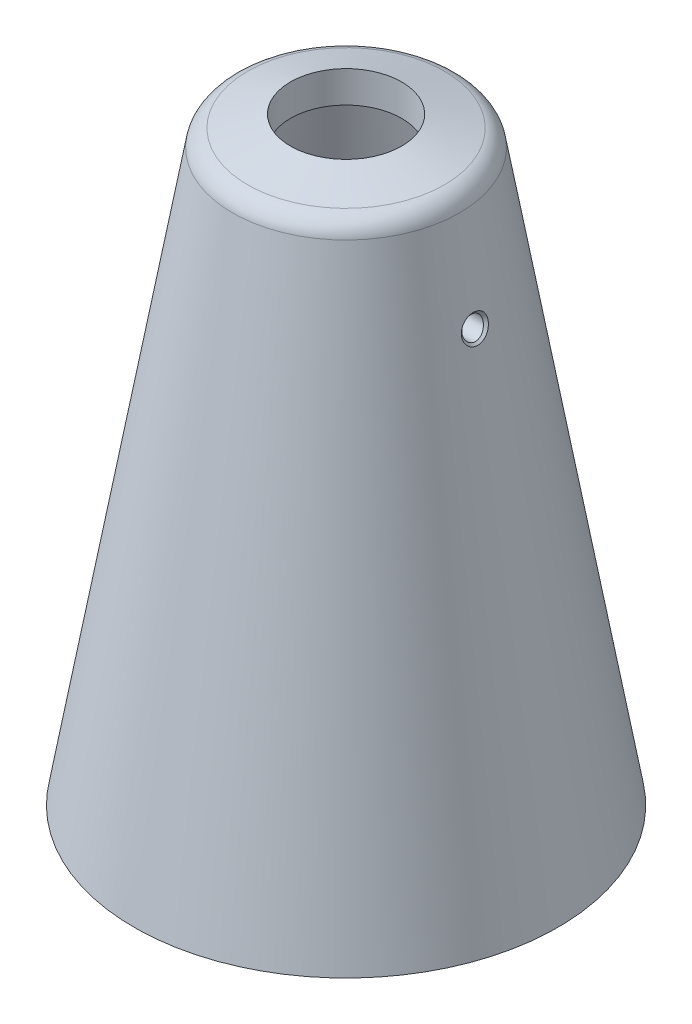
ISO-10303-21;
HEADER;
FILE_DESCRIPTION(('STEP AP214'),'2;1');
FILE_NAME('part.step','',(''),(''),'','','');
FILE_SCHEMA(('AUTOMOTIVE_DESIGN { 1 0 10303 214 1 1 1 1 }'));
ENDSEC;
DATA;
#1=APPLICATION_CONTEXT('core data for automotive mechanical design processes');
#2=APPLICATION_PROTOCOL_DEFINITION('international standard','automotive_design',2000,#1);
#3=PRODUCT_CONTEXT('',#1,'mechanical');
#4=PRODUCT('Part','Part','',(#3));
#5=PRODUCT_RELATED_PRODUCT_CATEGORY('part','',(#4));
#6=PRODUCT_DEFINITION_FORMATION('','',#4);
#7=PRODUCT_DEFINITION_CONTEXT('part definition',#1,'design');
#8=PRODUCT_DEFINITION('design','',#6,#7);
#9=PRODUCT_DEFINITION_SHAPE('','',#8);
#10=(LENGTH_UNIT() NAMED_UNIT(*) SI_UNIT(.MILLI.,.METRE.));
#11=(NAMED_UNIT(*) PLANE_ANGLE_UNIT() SI_UNIT($,.RADIAN.));
#12=(NAMED_UNIT(*) SI_UNIT($,.STERADIAN.) SOLID_ANGLE_UNIT());
#13=UNCERTAINTY_MEASURE_WITH_UNIT(LENGTH_MEASURE(1.E-05),#10,'distance_accuracy_value','');
#14=(GEOMETRIC_REPRESENTATION_CONTEXT(3) GLOBAL_UNCERTAINTY_ASSIGNED_CONTEXT((#13)) GLOBAL_UNIT_ASSIGNED_CONTEXT((#10,
#11,#12)) REPRESENTATION_CONTEXT('',''));
#15=CARTESIAN_POINT('',(0.,0.,0.));
#16=DIRECTION('',(0.,0.,1.));
#17=DIRECTION('',(1.,0.,0.));
#18=AXIS2_PLACEMENT_3D('',#15,#16,#17);
#19=CARTESIAN_POINT('',(25.4,-82.55,0.));
#20=DIRECTION('',(0.,1.,0.));
#21=DIRECTION('',(-1.,0.,0.));
#22=AXIS2_PLACEMENT_3D('',#19,#20,#21);
#23=PLANE('',#22);
#24=CARTESIAN_POINT('',(0.,-82.55,0.));
#25=DIRECTION('',(0.,1.,0.));
#26=DIRECTION('',(-1.,0.,0.));
#27=AXIS2_PLACEMENT_3D('',#24,#25,#26);
#28=CIRCLE('',#27,25.4);
#29=CARTESIAN_POINT('',(-25.4,-82.55,0.));
#30=VERTEX_POINT('',#29);
#31=EDGE_CURVE('E126',#30,#30,#28,.T.);
#32=ORIENTED_EDGE('',*,*,#31,.F.);
#33=EDGE_LOOP('',(#32));
#34=FACE_BOUND('',#33,.T.);
#35=CARTESIAN_POINT('',(0.,-82.55,0.));
#36=DIRECTION('',(0.,1.,0.));
#37=DIRECTION('',(-1.,0.,0.));
#38=AXIS2_PLACEMENT_3D('',#35,#36,#37);
#39=CIRCLE('',#38,22.1779854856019);
#40=CARTESIAN_POINT('',(-22.1779854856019,-82.55,0.));
#41=VERTEX_POINT('',#40);
#42=EDGE_CURVE('E65',#41,#41,#39,.T.);
#43=ORIENTED_EDGE('',*,*,#42,.T.);
#44=EDGE_LOOP('',(#43));
#45=FACE_BOUND('',#44,.T.);
#46=ADVANCED_FACE('F32',(#34,#45),#23,.F.);
#47=CARTESIAN_POINT('',(0.,-15.7159371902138,0.));
#48=DIRECTION('',(0.,-1.,0.));
#49=DIRECTION('',(1.,0.,0.));
#50=AXIS2_PLACEMENT_3D('',#47,#48,#49);
#51=CONICAL_SURFACE('',#50,10.6339200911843,0.171039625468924);
#52=CARTESIAN_POINT('',(-12.4362272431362,-26.3259805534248,-0.869172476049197));
#53=CARTESIAN_POINT('',(-12.4480885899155,-26.3738849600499,-0.818133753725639));
#54=CARTESIAN_POINT('',(-12.4591999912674,-26.4176753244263,-0.763005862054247));
#55=CARTESIAN_POINT('',(-12.4793130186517,-26.495711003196,-0.645964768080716));
#56=CARTESIAN_POINT('',(-12.4883130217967,-26.5299489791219,-0.584046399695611));
#57=CARTESIAN_POINT('',(-12.5036756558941,-26.5877883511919,-0.455036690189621));
#58=CARTESIAN_POINT('',(-12.510035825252,-26.6113798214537,-0.387940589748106));
#59=CARTESIAN_POINT('',(-12.5197046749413,-26.6470587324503,-0.250557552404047));
#60=CARTESIAN_POINT('',(-12.5230142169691,-26.6591494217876,-0.180271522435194));
#61=CARTESIAN_POINT('',(-12.5263332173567,-26.6712733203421,-0.0400986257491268));
#62=CARTESIAN_POINT('',(-12.5264112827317,-26.6715571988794,0.029765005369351));
#63=CARTESIAN_POINT('',(-12.5234359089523,-26.6606908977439,0.168526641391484));
#64=CARTESIAN_POINT('',(-12.5203825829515,-26.649541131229,0.237424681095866));
#65=CARTESIAN_POINT('',(-12.5113778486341,-26.6163470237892,0.371669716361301));
#66=CARTESIAN_POINT('',(-12.5054530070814,-26.5944025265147,0.437043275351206));
#67=CARTESIAN_POINT('',(-12.4910684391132,-26.5403789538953,0.563154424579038));
#68=CARTESIAN_POINT('',(-12.4826085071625,-26.5082990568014,0.623891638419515));
#69=CARTESIAN_POINT('',(-12.4634386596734,-26.4342544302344,0.740317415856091));
#70=CARTESIAN_POINT('',(-12.4526879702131,-26.3921086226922,0.795883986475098));
#71=CARTESIAN_POINT('',(-12.429617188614,-26.2995096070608,0.899220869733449));
#72=CARTESIAN_POINT('',(-12.4172968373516,-26.2490550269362,0.946989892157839));
#73=CARTESIAN_POINT('',(-12.3912875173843,-26.1394832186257,1.03496646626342));
#74=CARTESIAN_POINT('',(-12.3775675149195,-26.0801418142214,1.07488578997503));
#75=CARTESIAN_POINT('',(-12.3497624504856,-25.9556771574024,1.14420219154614));
#76=CARTESIAN_POINT('',(-12.3356773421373,-25.8905531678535,1.17359792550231));
#77=CARTESIAN_POINT('',(-12.3074790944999,-25.754919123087,1.22155938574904));
#78=CARTESIAN_POINT('',(-12.293370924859,-25.6843279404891,1.23989909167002));
#79=CARTESIAN_POINT('',(-12.2659838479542,-25.540891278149,1.26425517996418));
#80=CARTESIAN_POINT('',(-12.252704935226,-25.4680458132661,1.27027164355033));
#81=CARTESIAN_POINT('',(-12.2274728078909,-25.3224094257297,1.26971043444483));
#82=CARTESIAN_POINT('',(-12.2155154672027,-25.2496190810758,1.26317320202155));
#83=CARTESIAN_POINT('',(-12.1931936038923,-25.1060013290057,1.23765201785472));
#84=CARTESIAN_POINT('',(-12.1828289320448,-25.0351737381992,1.21866923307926));
#85=CARTESIAN_POINT('',(-12.1640136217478,-24.8987719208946,1.16912291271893));
#86=CARTESIAN_POINT('',(-12.1555341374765,-24.8331301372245,1.13875629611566));
#87=CARTESIAN_POINT('',(-12.1402919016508,-24.7078016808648,1.06722360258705));
#88=CARTESIAN_POINT('',(-12.1335290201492,-24.6481145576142,1.02605834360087));
#89=CARTESIAN_POINT('',(-12.1217026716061,-24.5372739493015,0.934714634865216));
#90=CARTESIAN_POINT('',(-12.116617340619,-24.4860154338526,0.884666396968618));
#91=CARTESIAN_POINT('',(-12.1078512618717,-24.3925823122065,0.776602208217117));
#92=CARTESIAN_POINT('',(-12.1041704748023,-24.3504074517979,0.718586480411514));
#93=CARTESIAN_POINT('',(-12.0980273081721,-24.2765668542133,0.596540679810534));
#94=CARTESIAN_POINT('',(-12.0955591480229,-24.2448514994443,0.532540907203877));
#95=CARTESIAN_POINT('',(-12.0916286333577,-24.1925728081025,0.400109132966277));
#96=CARTESIAN_POINT('',(-12.090166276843,-24.1720094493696,0.331677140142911));
#97=CARTESIAN_POINT('',(-12.0881102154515,-24.1426296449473,0.192327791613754));
#98=CARTESIAN_POINT('',(-12.0875164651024,-24.133812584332,0.121410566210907));
#99=CARTESIAN_POINT('',(-12.087134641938,-24.1281767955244,-0.0209014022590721));
#100=CARTESIAN_POINT('',(-12.0873465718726,-24.1313581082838,-0.0922961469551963));
#101=CARTESIAN_POINT('',(-12.0885993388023,-24.1496319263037,-0.233570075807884));
#102=CARTESIAN_POINT('',(-12.0896405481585,-24.1647297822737,-0.30344856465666));
#103=CARTESIAN_POINT('',(-12.0926570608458,-24.2064078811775,-0.439671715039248));
#104=CARTESIAN_POINT('',(-12.0946323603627,-24.2329880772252,-0.506016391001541));
#105=CARTESIAN_POINT('',(-12.0996836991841,-24.2968517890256,-0.633269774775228));
#106=CARTESIAN_POINT('',(-12.1027594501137,-24.3341325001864,-0.694179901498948));
#107=CARTESIAN_POINT('',(-12.1102094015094,-24.4183112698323,-0.808854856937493));
#108=CARTESIAN_POINT('',(-12.1145835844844,-24.4652091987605,-0.862619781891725));
#109=CARTESIAN_POINT('',(-12.1248156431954,-24.5672231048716,-0.961470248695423));
#110=CARTESIAN_POINT('',(-12.1306728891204,-24.6223355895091,-1.00655946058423));
#111=CARTESIAN_POINT('',(-12.1440054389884,-24.7391715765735,-1.08684407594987));
#112=CARTESIAN_POINT('',(-12.151480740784,-24.8008950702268,-1.1220394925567));
#113=CARTESIAN_POINT('',(-12.1681130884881,-24.9293225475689,-1.18168915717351));
#114=CARTESIAN_POINT('',(-12.177274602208,-24.9960394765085,-1.20611427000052));
#115=CARTESIAN_POINT('',(-12.1971866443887,-25.1323807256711,-1.24349397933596));
#116=CARTESIAN_POINT('',(-12.2079371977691,-25.2020050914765,-1.256448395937));
#117=CARTESIAN_POINT('',(-12.2309369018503,-25.3429498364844,-1.27071455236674));
#118=CARTESIAN_POINT('',(-12.2432006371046,-25.4142803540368,-1.27190229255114));
#119=CARTESIAN_POINT('',(-12.2687881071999,-25.5559676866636,-1.26238569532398));
#120=CARTESIAN_POINT('',(-12.2821121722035,-25.6263241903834,-1.25167764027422));
#121=CARTESIAN_POINT('',(-12.3095863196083,-25.7653588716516,-1.21844638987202));
#122=CARTESIAN_POINT('',(-12.3237467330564,-25.8339866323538,-1.19572109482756));
#123=CARTESIAN_POINT('',(-12.3520792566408,-25.966357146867,-1.13899780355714));
#124=CARTESIAN_POINT('',(-12.3662513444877,-26.0301042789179,-1.10501005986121));
#125=CARTESIAN_POINT('',(-12.389940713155,-26.1334897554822,-1.03803485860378));
#126=CARTESIAN_POINT('',(-12.3996188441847,-26.1747687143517,-1.00760081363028));
#127=CARTESIAN_POINT('',(-12.4184084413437,-26.2534309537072,-0.941903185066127));
#128=CARTESIAN_POINT('',(-12.4275199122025,-26.2908142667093,-0.906639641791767));
#129=CARTESIAN_POINT('',(-12.4362272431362,-26.3259805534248,-0.869172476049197));
#130=B_SPLINE_CURVE_WITH_KNOTS('',3,(#52,#53,#54,#55,#56,#57,#58,#59,#60,#61,#62,#63,#64,#65,
#66,#67,#68,#69,#70,#71,#72,#73,#74,#75,#76,#77,#78,#79,#80,#81,#82,#83,#84,#85,#86,#87,#88,#89,
#90,#91,#92,#93,#94,#95,#96,#97,#98,#99,#100,#101,#102,#103,#104,#105,#106,#107,#108,#109,#110,
#111,#112,#113,#114,#115,#116,#117,#118,#119,#120,#121,#122,#123,#124,#125,#126,#127,#128,#129),
.UNSPECIFIED.,.T.,.F.,(4,2,2,2,2,2,2,2,2,2,2,2,2,2,2,2,2,2,2,2,2,2,2,2,2,2,2,2,2,2,2,2,2,2,2,2,
2,2,4),(0.,0.212807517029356,0.425778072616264,0.638946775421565,0.852055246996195,
1.06063686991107,1.26921095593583,1.47589115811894,1.68258812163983,1.89332818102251,
2.10410307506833,2.32157001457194,2.53906471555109,2.76086693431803,2.98266769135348,
3.20375514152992,3.42482186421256,3.64222888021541,3.85961943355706,4.07405307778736,
4.28848072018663,4.50187602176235,4.71527089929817,4.92865460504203,5.14203903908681,
5.35551934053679,5.56899877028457,5.7824222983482,5.99584295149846,6.20917312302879,
6.42250301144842,6.63640649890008,6.85031334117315,7.06647200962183,7.28269825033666,
7.50268225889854,7.72246655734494,7.87868835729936,8.03490885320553),.UNSPECIFIED.);
#131=CARTESIAN_POINT('',(-12.4362272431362,-26.3259805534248,-0.869172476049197));
#132=VERTEX_POINT('',#131);
#133=EDGE_CURVE('E121',#132,#132,#130,.T.);
#134=ORIENTED_EDGE('',*,*,#133,.T.);
#135=EDGE_LOOP('',(#134));
#136=FACE_BOUND('',#135,.T.);
#137=CARTESIAN_POINT('',(12.4222019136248,-26.2688212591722,-0.926309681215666));
#138=CARTESIAN_POINT('',(12.4093048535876,-26.2157777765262,-0.976057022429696));
#139=CARTESIAN_POINT('',(12.3957095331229,-26.158501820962,-1.02119320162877));
#140=CARTESIAN_POINT('',(12.3678326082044,-26.0371507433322,-1.1010117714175));
#141=CARTESIAN_POINT('',(12.3535500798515,-25.9730663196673,-1.13567960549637));
#142=CARTESIAN_POINT('',(12.3249941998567,-25.8399625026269,-1.19356332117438));
#143=CARTESIAN_POINT('',(12.3107208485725,-25.7709464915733,-1.21678696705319));
#144=CARTESIAN_POINT('',(12.2827846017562,-25.629869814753,-1.25113113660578));
#145=CARTESIAN_POINT('',(12.2691215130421,-25.5578101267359,-1.26225551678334));
#146=CARTESIAN_POINT('',(12.2428980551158,-25.4126085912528,-1.272020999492));
#147=CARTESIAN_POINT('',(12.2303382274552,-25.3394662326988,-1.27065600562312));
#148=CARTESIAN_POINT('',(12.2067057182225,-25.1942594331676,-1.25534834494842));
#149=CARTESIAN_POINT('',(12.195632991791,-25.1221949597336,-1.24140605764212));
#150=CARTESIAN_POINT('',(12.1753597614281,-24.9823954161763,-1.20154435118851));
#151=CARTESIAN_POINT('',(12.1661332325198,-24.9146110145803,-1.17581121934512));
#152=CARTESIAN_POINT('',(12.1494181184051,-24.7842351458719,-1.11308812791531));
#153=CARTESIAN_POINT('',(12.1419293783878,-24.7216432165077,-1.07609917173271));
#154=CARTESIAN_POINT('',(12.1287354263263,-24.6044613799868,-0.992531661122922));
#155=CARTESIAN_POINT('',(12.1230049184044,-24.549764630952,-0.946106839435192));
#156=CARTESIAN_POINT('',(12.1130310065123,-24.4488940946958,-0.844638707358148));
#157=CARTESIAN_POINT('',(12.1087875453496,-24.4027199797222,-0.789595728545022));
#158=CARTESIAN_POINT('',(12.1016162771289,-24.3205356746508,-0.672845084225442));
#159=CARTESIAN_POINT('',(12.0986801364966,-24.284461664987,-0.611182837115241));
#160=CARTESIAN_POINT('',(12.0938871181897,-24.223133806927,-0.482655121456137));
#161=CARTESIAN_POINT('',(12.0920302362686,-24.1978799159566,-0.415789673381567));
#162=CARTESIAN_POINT('',(12.089235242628,-24.1589356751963,-0.278796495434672));
#163=CARTESIAN_POINT('',(12.0882965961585,-24.1452385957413,-0.208670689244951));
#164=CARTESIAN_POINT('',(12.087240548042,-24.1297771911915,-0.0671095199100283));
#165=CARTESIAN_POINT('',(12.0871231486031,-24.1280128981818,0.0043258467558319));
#166=CARTESIAN_POINT('',(12.0876970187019,-24.1364701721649,0.146518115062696));
#167=CARTESIAN_POINT('',(12.0883887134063,-24.1466980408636,0.217274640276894));
#168=CARTESIAN_POINT('',(12.0906540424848,-24.1788555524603,0.35606206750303));
#169=CARTESIAN_POINT('',(12.0922276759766,-24.2007851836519,0.42409297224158));
#170=CARTESIAN_POINT('',(12.0964014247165,-24.2557091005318,0.555489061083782));
#171=CARTESIAN_POINT('',(12.0990014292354,-24.2887021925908,0.618854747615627));
#172=CARTESIAN_POINT('',(12.1054176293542,-24.3647928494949,0.739127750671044));
#173=CARTESIAN_POINT('',(12.1092338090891,-24.4078902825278,0.796035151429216));
#174=CARTESIAN_POINT('',(12.1182768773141,-24.5029006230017,0.901754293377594));
#175=CARTESIAN_POINT('',(12.1235030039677,-24.5548087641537,0.950570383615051));
#176=CARTESIAN_POINT('',(12.1355275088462,-24.6659289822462,1.038783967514));
#177=CARTESIAN_POINT('',(12.1423258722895,-24.7251409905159,1.07818154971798));
#178=CARTESIAN_POINT('',(12.1575905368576,-24.8492324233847,1.14655202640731));
#179=CARTESIAN_POINT('',(12.166059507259,-24.9141208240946,1.17550802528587));
#180=CARTESIAN_POINT('',(12.1846314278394,-25.0475986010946,1.22217537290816));
#181=CARTESIAN_POINT('',(12.1947344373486,-25.1161881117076,1.23988631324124));
#182=CARTESIAN_POINT('',(12.2165136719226,-25.2557331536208,1.26378079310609));
#183=CARTESIAN_POINT('',(12.22820289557,-25.3267041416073,1.26986205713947));
#184=CARTESIAN_POINT('',(12.2527908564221,-25.4684580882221,1.27013333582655));
#185=CARTESIAN_POINT('',(12.265689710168,-25.5392410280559,1.26432220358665));
#186=CARTESIAN_POINT('',(12.2924970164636,-25.6798569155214,1.24086406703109));
#187=CARTESIAN_POINT('',(12.3064185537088,-25.7496552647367,1.22302458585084));
#188=CARTESIAN_POINT('',(12.3345334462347,-25.8852001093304,1.17585359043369));
#189=CARTESIAN_POINT('',(12.3487268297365,-25.9509461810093,1.14652087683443));
#190=CARTESIAN_POINT('',(12.376941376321,-26.0774294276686,1.07669621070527));
#191=CARTESIAN_POINT('',(12.3909579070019,-26.1380904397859,1.03606424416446));
#192=CARTESIAN_POINT('',(12.4179263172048,-26.2517110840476,0.944877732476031));
#193=CARTESIAN_POINT('',(12.4308781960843,-26.304670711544,0.894323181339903));
#194=CARTESIAN_POINT('',(12.4549277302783,-26.4009829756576,0.784987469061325));
#195=CARTESIAN_POINT('',(12.4660369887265,-26.4443963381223,0.726262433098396));
#196=CARTESIAN_POINT('',(12.4858452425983,-26.5206596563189,0.601944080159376));
#197=CARTESIAN_POINT('',(12.4945446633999,-26.55351147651,0.536351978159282));
#198=CARTESIAN_POINT('',(12.5087747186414,-26.6067535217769,0.402132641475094));
#199=CARTESIAN_POINT('',(12.5143878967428,-26.6274694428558,0.333643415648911));
#200=CARTESIAN_POINT('',(12.5224538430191,-26.6571243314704,0.193986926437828));
#201=CARTESIAN_POINT('',(12.5249073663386,-26.6660661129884,0.122820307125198));
#202=CARTESIAN_POINT('',(12.526470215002,-26.6717688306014,-0.0179487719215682));
#203=CARTESIAN_POINT('',(12.5256749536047,-26.6688772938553,-0.0875363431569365));
#204=CARTESIAN_POINT('',(12.5210048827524,-26.6517942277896,-0.225217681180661));
#205=CARTESIAN_POINT('',(12.5171295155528,-26.6376006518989,-0.293311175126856));
#206=CARTESIAN_POINT('',(12.5065645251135,-26.5984913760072,-0.425754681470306));
#207=CARTESIAN_POINT('',(12.4998880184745,-26.5736256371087,-0.490120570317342));
#208=CARTESIAN_POINT('',(12.4841168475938,-26.5139883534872,-0.613701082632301));
#209=CARTESIAN_POINT('',(12.4750245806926,-26.4792266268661,-0.672920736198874));
#210=CARTESIAN_POINT('',(12.4585388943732,-26.4149439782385,-0.764662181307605));
#211=CARTESIAN_POINT('',(12.4517066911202,-26.3880188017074,-0.79913856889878));
#212=CARTESIAN_POINT('',(12.4374004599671,-26.3308422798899,-0.865064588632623));
#213=CARTESIAN_POINT('',(12.4299264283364,-26.3005909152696,-0.896514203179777));
#214=CARTESIAN_POINT('',(12.4222019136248,-26.2688212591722,-0.926309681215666));
#215=B_SPLINE_CURVE_WITH_KNOTS('',3,(#137,#138,#139,#140,#141,#142,#143,#144,#145,#146,#147,
#148,#149,#150,#151,#152,#153,#154,#155,#156,#157,#158,#159,#160,#161,#162,#163,#164,#165,#166,
#167,#168,#169,#170,#171,#172,#173,#174,#175,#176,#177,#178,#179,#180,#181,#182,#183,#184,#185,
#186,#187,#188,#189,#190,#191,#192,#193,#194,#195,#196,#197,#198,#199,#200,#201,#202,#203,#204,
#205,#206,#207,#208,#209,#210,#211,#212,#213,#214),.UNSPECIFIED.,.T.,.F.,(4,2,2,2,2,2,2,2,2,2,2,
2,2,2,2,2,2,2,2,2,2,2,2,2,2,2,2,2,2,2,2,2,2,2,2,2,2,2,4),(0.,0.221405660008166,0.44311778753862,
0.66467928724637,0.886170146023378,1.10776912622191,1.32936142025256,1.54756739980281,
1.76575393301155,1.98063574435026,2.1955092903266,2.40899278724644,2.62247544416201,
2.83583370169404,3.04919253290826,3.262663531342,3.47613431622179,3.68958207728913,
3.90302705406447,4.11635693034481,4.32968480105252,4.54335632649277,4.7570356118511,
4.97258557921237,5.18815633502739,5.40726118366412,5.62638890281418,5.84836319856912,
6.07033762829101,6.29085632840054,6.511336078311,6.72558989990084,6.93979250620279,
7.14775012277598,7.35574540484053,7.56277741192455,7.76960472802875,7.9022117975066,
8.03481963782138),.UNSPECIFIED.);
#216=CARTESIAN_POINT('',(12.4222019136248,-26.2688212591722,-0.926309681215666));
#217=VERTEX_POINT('',#216);
#218=EDGE_CURVE('E116',#217,#217,#215,.T.);
#219=ORIENTED_EDGE('',*,*,#218,.T.);
#220=EDGE_LOOP('',(#219));
#221=FACE_BOUND('',#220,.T.);
#222=ORIENTED_EDGE('',*,*,#42,.F.);
#223=EDGE_LOOP('',(#222));
#224=FACE_BOUND('',#223,.T.);
#225=CARTESIAN_POINT('',(0.,-15.7159371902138,0.));
#226=DIRECTION('',(0.,1.,0.));
#227=DIRECTION('',(-1.,0.,0.));
#228=AXIS2_PLACEMENT_3D('',#225,#226,#227);
#229=CIRCLE('',#228,10.6339200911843);
#230=CARTESIAN_POINT('',(-10.6339200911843,-15.7159371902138,0.));
#231=VERTEX_POINT('',#230);
#232=EDGE_CURVE('E156',#231,#231,#229,.T.);
#233=ORIENTED_EDGE('',*,*,#232,.T.);
#234=EDGE_LOOP('',(#233));
#235=FACE_BOUND('',#234,.T.);
#236=ADVANCED_FACE('F128',(#136,#221,#224,#235),#51,.F.);
#237=CARTESIAN_POINT('',(0.,-14.5910017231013,0.));
#238=DIRECTION('',(0.,-1.,0.));
#239=DIRECTION('',(1.,0.,0.));
#240=AXIS2_PLACEMENT_3D('',#237,#238,#239);
#241=CONICAL_SURFACE('',#240,6.6675,1.29443877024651);
#242=ORIENTED_EDGE('',*,*,#232,.F.);
#243=EDGE_LOOP('',(#242));
#244=FACE_BOUND('',#243,.T.);
#245=CARTESIAN_POINT('',(0.,-14.5910017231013,0.));
#246=DIRECTION('',(0.,1.,0.));
#247=DIRECTION('',(-1.,0.,0.));
#248=AXIS2_PLACEMENT_3D('',#245,#246,#247);
#249=CIRCLE('',#248,6.6675);
#250=CARTESIAN_POINT('',(-6.6675,-14.5910017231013,0.));
#251=VERTEX_POINT('',#250);
#252=EDGE_CURVE('E158',#251,#251,#249,.T.);
#253=ORIENTED_EDGE('',*,*,#252,.T.);
#254=EDGE_LOOP('',(#253));
#255=FACE_BOUND('',#254,.T.);
#256=ADVANCED_FACE('F132',(#244,#255),#241,.F.);
#257=CARTESIAN_POINT('',(0.,-12.7,0.));
#258=DIRECTION('',(0.,1.,0.));
#259=DIRECTION('',(-1.,0.,0.));
#260=AXIS2_PLACEMENT_3D('',#257,#258,#259);
#261=CYLINDRICAL_SURFACE('',#260,6.6675);
#262=ORIENTED_EDGE('',*,*,#252,.F.);
#263=EDGE_LOOP('',(#262));
#264=FACE_BOUND('',#263,.T.);
#265=CARTESIAN_POINT('',(0.,-10.8089982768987,0.));
#266=DIRECTION('',(0.,1.,0.));
#267=DIRECTION('',(-1.,0.,0.));
#268=AXIS2_PLACEMENT_3D('',#265,#266,#267);
#269=CIRCLE('',#268,6.6675);
#270=CARTESIAN_POINT('',(-6.6675,-10.8089982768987,0.));
#271=VERTEX_POINT('',#270);
#272=EDGE_CURVE('E162',#271,#271,#269,.T.);
#273=ORIENTED_EDGE('',*,*,#272,.T.);
#274=EDGE_LOOP('',(#273));
#275=FACE_BOUND('',#274,.T.);
#276=ADVANCED_FACE('F136',(#264,#275),#261,.F.);
#277=CARTESIAN_POINT('',(0.,-12.7,0.));
#278=DIRECTION('',(0.,-1.,0.));
#279=DIRECTION('',(1.,0.,0.));
#280=AXIS2_PLACEMENT_3D('',#277,#278,#279);
#281=CONICAL_SURFACE('',#280,13.335,1.2944387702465);
#282=CARTESIAN_POINT('',(0.,-12.2638517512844,0.));
#283=DIRECTION('',(0.,1.,0.));
#284=DIRECTION('',(-1.,0.,0.));
#285=AXIS2_PLACEMENT_3D('',#282,#283,#284);
#286=CIRCLE('',#285,11.7971809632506);
#287=CARTESIAN_POINT('',(-11.7971809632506,-12.2638517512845,0.));
#288=VERTEX_POINT('',#287);
#289=EDGE_CURVE('E60',#288,#288,#286,.T.);
#290=ORIENTED_EDGE('',*,*,#289,.T.);
#291=EDGE_LOOP('',(#290));
#292=FACE_BOUND('',#291,.T.);
#293=ORIENTED_EDGE('',*,*,#272,.F.);
#294=EDGE_LOOP('',(#293));
#295=FACE_BOUND('',#294,.T.);
#296=ADVANCED_FACE('F84',(#292,#295),#281,.T.);
#297=CARTESIAN_POINT('',(0.,-82.55,0.));
#298=DIRECTION('',(0.,-1.,0.));
#299=DIRECTION('',(1.,0.,0.));
#300=AXIS2_PLACEMENT_3D('',#297,#298,#299);
#301=CONICAL_SURFACE('',#300,25.4,0.171039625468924);
#302=CARTESIAN_POINT('',(-15.6654591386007,-26.3917791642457,-1.04001025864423));
#303=CARTESIAN_POINT('',(-15.6694980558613,-26.4084766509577,-1.02303615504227));
#304=CARTESIAN_POINT('',(-15.6734542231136,-26.4247475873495,-1.00562410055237));
#305=CARTESIAN_POINT('',(-15.6811905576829,-26.4564142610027,-0.969974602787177));
#306=CARTESIAN_POINT('',(-15.6849706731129,-26.4718097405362,-0.951736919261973));
#307=CARTESIAN_POINT('',(-15.6923436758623,-26.5017002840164,-0.914488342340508));
#308=CARTESIAN_POINT('',(-15.6959364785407,-26.5161949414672,-0.895477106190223));
#309=CARTESIAN_POINT('',(-15.7029237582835,-26.5442591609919,-0.856733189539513));
#310=CARTESIAN_POINT('',(-15.7063181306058,-26.5578282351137,-0.837000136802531));
#311=CARTESIAN_POINT('',(-15.7128973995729,-26.5840163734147,-0.796864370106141));
#312=CARTESIAN_POINT('',(-15.7160821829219,-26.5966349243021,-0.776461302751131));
#313=CARTESIAN_POINT('',(-15.7222311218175,-26.6208970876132,-0.735037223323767));
#314=CARTESIAN_POINT('',(-15.7251951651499,-26.6325402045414,-0.714015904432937));
#315=CARTESIAN_POINT('',(-15.730891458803,-26.6548265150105,-0.671407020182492));
#316=CARTESIAN_POINT('',(-15.7336236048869,-26.6654692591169,-0.649819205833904));
#317=CARTESIAN_POINT('',(-15.7388449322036,-26.6857298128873,-0.606129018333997));
#318=CARTESIAN_POINT('',(-15.7413340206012,-26.6953472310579,-0.584026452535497));
#319=CARTESIAN_POINT('',(-15.746058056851,-26.7135321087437,-0.539358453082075));
#320=CARTESIAN_POINT('',(-15.7482929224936,-26.7220992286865,-0.516792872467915));
#321=CARTESIAN_POINT('',(-15.7524973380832,-26.7381584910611,-0.471250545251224));
#322=CARTESIAN_POINT('',(-15.7544668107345,-26.745650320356,-0.448273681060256));
#323=CARTESIAN_POINT('',(-15.7581292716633,-26.7595340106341,-0.401960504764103));
#324=CARTESIAN_POINT('',(-15.7598221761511,-26.7659255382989,-0.378624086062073));
#325=CARTESIAN_POINT('',(-15.7629203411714,-26.7775836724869,-0.331643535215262));
#326=CARTESIAN_POINT('',(-15.7643254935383,-26.7828498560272,-0.307999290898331));
#327=CARTESIAN_POINT('',(-15.7668370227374,-26.792232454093,-0.26045484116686));
#328=CARTESIAN_POINT('',(-15.7679432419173,-26.7963482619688,-0.236554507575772));
#329=CARTESIAN_POINT('',(-15.7698457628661,-26.8034052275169,-0.188549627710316));
#330=CARTESIAN_POINT('',(-15.770641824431,-26.8063454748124,-0.164444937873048));
#331=CARTESIAN_POINT('',(-15.7719130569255,-26.8110270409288,-0.116083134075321));
#332=CARTESIAN_POINT('',(-15.7723878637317,-26.8127669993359,-0.0918258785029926));
#333=CARTESIAN_POINT('',(-15.7730051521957,-26.8150220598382,-0.0432105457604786));
#334=CARTESIAN_POINT('',(-15.7731470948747,-26.8155351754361,-0.0188523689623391));
#335=CARTESIAN_POINT('',(-15.7730892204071,-26.8153177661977,0.0298587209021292));
#336=CARTESIAN_POINT('',(-15.7728893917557,-26.8145871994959,0.0542116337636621));
#337=CARTESIAN_POINT('',(-15.7721594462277,-26.8119080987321,0.102806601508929));
#338=CARTESIAN_POINT('',(-15.7716298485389,-26.8099614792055,0.12704877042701));
#339=CARTESIAN_POINT('',(-15.7702513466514,-26.804874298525,0.175370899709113));
#340=CARTESIAN_POINT('',(-15.7694027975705,-26.8017350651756,0.199451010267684));
#341=CARTESIAN_POINT('',(-15.767397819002,-26.794288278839,0.247397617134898));
#342=CARTESIAN_POINT('',(-15.7662416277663,-26.7899816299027,0.271264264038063));
#343=CARTESIAN_POINT('',(-15.763632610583,-26.780224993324,0.318732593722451));
#344=CARTESIAN_POINT('',(-15.7621799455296,-26.7747756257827,0.342334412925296));
#345=CARTESIAN_POINT('',(-15.7589892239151,-26.7627585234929,0.389221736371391));
#346=CARTESIAN_POINT('',(-15.7572512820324,-26.7561912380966,0.412507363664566));
#347=CARTESIAN_POINT('',(-15.7535012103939,-26.7419631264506,0.458710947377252));
#348=CARTESIAN_POINT('',(-15.7514891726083,-26.7343026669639,0.481629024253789));
#349=CARTESIAN_POINT('',(-15.7472020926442,-26.7179129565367,0.527046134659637));
#350=CARTESIAN_POINT('',(-15.7449271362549,-26.7091840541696,0.54954530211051));
#351=CARTESIAN_POINT('',(-15.7401253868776,-26.6906821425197,0.594073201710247));
#352=CARTESIAN_POINT('',(-15.7375986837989,-26.6809095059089,0.61610209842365));
#353=CARTESIAN_POINT('',(-15.7323045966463,-26.6603447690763,0.659638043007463));
#354=CARTESIAN_POINT('',(-15.7295373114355,-26.649553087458,0.681145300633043));
#355=CARTESIAN_POINT('',(-15.7237732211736,-26.626974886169,0.723586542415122));
#356=CARTESIAN_POINT('',(-15.7207765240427,-26.6151888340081,0.744520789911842));
#357=CARTESIAN_POINT('',(-15.7145647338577,-26.5906465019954,0.785764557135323));
#358=CARTESIAN_POINT('',(-15.7113497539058,-26.5778907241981,0.806074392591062));
#359=CARTESIAN_POINT('',(-15.7047126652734,-26.5514336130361,0.846017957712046));
#360=CARTESIAN_POINT('',(-15.7012906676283,-26.5377327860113,0.865652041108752));
#361=CARTESIAN_POINT('',(-15.6942502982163,-26.5094101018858,0.904192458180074));
#362=CARTESIAN_POINT('',(-15.6906320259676,-26.4947887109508,0.923099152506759));
#363=CARTESIAN_POINT('',(-15.6832118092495,-26.4646501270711,0.960134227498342));
#364=CARTESIAN_POINT('',(-15.6794099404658,-26.4491333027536,0.978262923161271));
#365=CARTESIAN_POINT('',(-15.6716280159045,-26.4172266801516,1.01368758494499));
#366=CARTESIAN_POINT('',(-15.667648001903,-26.4008370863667,1.03098374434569));
#367=CARTESIAN_POINT('',(-15.6595459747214,-26.3672324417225,1.06468806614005));
#368=CARTESIAN_POINT('',(-15.6554240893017,-26.3500181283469,1.08109699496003));
#369=CARTESIAN_POINT('',(-15.6470781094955,-26.314833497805,1.11300159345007));
#370=CARTESIAN_POINT('',(-15.6428541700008,-26.2968642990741,1.12849853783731));
#371=CARTESIAN_POINT('',(-15.6343132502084,-26.2602156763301,1.15855705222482));
#372=CARTESIAN_POINT('',(-15.6299963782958,-26.241537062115,1.17311964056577));
#373=CARTESIAN_POINT('',(-15.6212859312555,-26.2035176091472,1.20129126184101));
#374=CARTESIAN_POINT('',(-15.6168924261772,-26.1841773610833,1.2149011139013));
#375=CARTESIAN_POINT('',(-15.6080431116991,-26.1448819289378,1.24114794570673));
#376=CARTESIAN_POINT('',(-15.6035873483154,-26.1249271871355,1.25378560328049));
#377=CARTESIAN_POINT('',(-15.5946284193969,-26.0844501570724,1.27806895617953));
#378=CARTESIAN_POINT('',(-15.5901252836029,-26.0639282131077,1.28971523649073));
#379=CARTESIAN_POINT('',(-15.5810863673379,-26.0223640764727,1.31199661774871));
#380=CARTESIAN_POINT('',(-15.5765506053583,-26.0013221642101,1.32263224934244));
#381=CARTESIAN_POINT('',(-15.5674612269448,-25.9587653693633,1.34287309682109));
#382=CARTESIAN_POINT('',(-15.5629076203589,-25.937250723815,1.35247881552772));
#383=CARTESIAN_POINT('',(-15.5537973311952,-25.8937957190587,1.37064056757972));
#384=CARTESIAN_POINT('',(-15.5492406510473,-25.8718555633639,1.37919708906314));
#385=CARTESIAN_POINT('',(-15.5401389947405,-25.8275967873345,1.39524116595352));
#386=CARTESIAN_POINT('',(-15.535594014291,-25.8052783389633,1.40272919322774));
#387=CARTESIAN_POINT('',(-15.526530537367,-25.7603102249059,1.41661699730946));
#388=CARTESIAN_POINT('',(-15.5220120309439,-25.7376606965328,1.4230172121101));
#389=CARTESIAN_POINT('',(-15.5130162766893,-25.6920776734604,1.43471014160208));
#390=CARTESIAN_POINT('',(-15.508539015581,-25.6691442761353,1.44000322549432));
#391=CARTESIAN_POINT('',(-15.4996405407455,-25.623040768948,1.44946261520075));
#392=CARTESIAN_POINT('',(-15.4952193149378,-25.599870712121,1.45362916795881));
#393=CARTESIAN_POINT('',(-15.4864476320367,-25.5533411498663,1.46081650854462));
#394=CARTESIAN_POINT('',(-15.4820971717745,-25.5299816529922,1.4638373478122));
#395=CARTESIAN_POINT('',(-15.4734819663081,-25.4831204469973,1.46871346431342));
#396=CARTESIAN_POINT('',(-15.4692172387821,-25.45961870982,1.47056850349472));
#397=CARTESIAN_POINT('',(-15.4607875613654,-25.4125203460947,1.47309661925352));
#398=CARTESIAN_POINT('',(-15.456622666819,-25.3889236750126,1.47376905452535));
#399=CARTESIAN_POINT('',(-15.448414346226,-25.3417076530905,1.47390327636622));
#400=CARTESIAN_POINT('',(-15.4443709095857,-25.318088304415,1.47336516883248));
#401=CARTESIAN_POINT('',(-15.4364151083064,-25.2709033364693,1.47108417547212));
#402=CARTESIAN_POINT('',(-15.4325026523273,-25.2473376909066,1.46934214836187));
#403=CARTESIAN_POINT('',(-15.4248104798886,-25.2003114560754,1.46467408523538));
#404=CARTESIAN_POINT('',(-15.4210307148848,-25.176850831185,1.46174848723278));
#405=CARTESIAN_POINT('',(-15.4136064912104,-25.1300859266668,1.45473061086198));
#406=CARTESIAN_POINT('',(-15.4099620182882,-25.1067816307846,1.45063845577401));
#407=CARTESIAN_POINT('',(-15.4028107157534,-25.0603806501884,1.4413055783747));
#408=CARTESIAN_POINT('',(-15.399303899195,-25.0372839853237,1.43606474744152));
#409=CARTESIAN_POINT('',(-15.3924303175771,-24.9913495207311,1.42445231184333));
#410=CARTESIAN_POINT('',(-15.3890635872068,-24.9685117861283,1.41808042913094));
#411=CARTESIAN_POINT('',(-15.3824725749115,-24.9231464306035,1.40422368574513));
#412=CARTESIAN_POINT('',(-15.3792483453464,-24.9006189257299,1.39673842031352));
#413=CARTESIAN_POINT('',(-15.3729447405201,-24.8559252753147,1.38067264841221));
#414=CARTESIAN_POINT('',(-15.3698654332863,-24.833759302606,1.37209163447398));
#415=CARTESIAN_POINT('',(-15.3638540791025,-24.7898399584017,1.35385208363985));
#416=CARTESIAN_POINT('',(-15.3609221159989,-24.7680868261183,1.34419294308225));
#417=CARTESIAN_POINT('',(-15.3552078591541,-24.7250443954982,1.32381485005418));
#418=CARTESIAN_POINT('',(-15.3524256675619,-24.7037554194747,1.31309518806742));
#419=CARTESIAN_POINT('',(-15.3470133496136,-24.6616925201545,1.29061377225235));
#420=CARTESIAN_POINT('',(-15.3443833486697,-24.6409190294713,1.27885117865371));
#421=CARTESIAN_POINT('',(-15.3392778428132,-24.5999382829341,1.2543016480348));
#422=CARTESIAN_POINT('',(-15.3368024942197,-24.5797316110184,1.24151370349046));
#423=CARTESIAN_POINT('',(-15.3320085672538,-24.5399356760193,1.21493124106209));
#424=CARTESIAN_POINT('',(-15.3296901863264,-24.5203472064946,1.20113549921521));
#425=CARTESIAN_POINT('',(-15.3252130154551,-24.4818386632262,1.1725553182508));
#426=CARTESIAN_POINT('',(-15.3230544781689,-24.4629196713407,1.15776938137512));
#427=CARTESIAN_POINT('',(-15.3188977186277,-24.4258014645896,1.1272265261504));
#428=CARTESIAN_POINT('',(-15.316899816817,-24.4076037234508,1.11146777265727));
#429=CARTESIAN_POINT('',(-15.313072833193,-24.3719775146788,1.07899787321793));
#430=CARTESIAN_POINT('',(-15.311244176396,-24.354551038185,1.06228449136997));
#431=CARTESIAN_POINT('',(-15.30773830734,-24.3205557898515,1.02795367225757));
#432=CARTESIAN_POINT('',(-15.3060612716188,-24.3039880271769,1.01033521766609));
#433=CARTESIAN_POINT('',(-15.3028358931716,-24.2717714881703,0.974274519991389));
#434=CARTESIAN_POINT('',(-15.3012875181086,-24.2561224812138,0.955832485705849));
#435=CARTESIAN_POINT('',(-15.2983221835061,-24.2257633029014,0.918179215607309));
#436=CARTESIAN_POINT('',(-15.296905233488,-24.2110531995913,0.898967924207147));
#437=CARTESIAN_POINT('',(-15.2941976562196,-24.1825935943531,0.859829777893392));
#438=CARTESIAN_POINT('',(-15.2929070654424,-24.168844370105,0.839902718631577));
#439=CARTESIAN_POINT('',(-15.2904492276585,-24.1423278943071,0.799386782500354));
#440=CARTESIAN_POINT('',(-15.2892820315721,-24.1295610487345,0.778797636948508));
#441=CARTESIAN_POINT('',(-15.2870674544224,-24.1050309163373,0.737011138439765));
#442=CARTESIAN_POINT('',(-15.2860201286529,-24.0932680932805,0.71581351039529));
#443=CARTESIAN_POINT('',(-15.2840419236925,-24.0707676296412,0.672863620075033));
#444=CARTESIAN_POINT('',(-15.2831110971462,-24.0600304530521,0.651111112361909));
#445=CARTESIAN_POINT('',(-15.2813624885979,-24.0396029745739,0.607104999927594));
#446=CARTESIAN_POINT('',(-15.280544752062,-24.0299130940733,0.584851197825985));
#447=CARTESIAN_POINT('',(-15.2790189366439,-24.0116019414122,0.539896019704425));
#448=CARTESIAN_POINT('',(-15.2783108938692,-24.0029810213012,0.517194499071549));
#449=CARTESIAN_POINT('',(-15.2770010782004,-23.9868295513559,0.47139740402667));
#450=CARTESIAN_POINT('',(-15.2763993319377,-23.9792992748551,0.448301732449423));
#451=CARTESIAN_POINT('',(-15.2752987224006,-23.9653508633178,0.401769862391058));
#452=CARTESIAN_POINT('',(-15.274799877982,-23.9589329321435,0.37833360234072));
#453=CARTESIAN_POINT('',(-15.2739016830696,-23.9472309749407,0.331174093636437));
#454=CARTESIAN_POINT('',(-15.273502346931,-23.9419471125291,0.307450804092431));
#455=CARTESIAN_POINT('',(-15.2727997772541,-23.9325350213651,0.259770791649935));
#456=CARTESIAN_POINT('',(-15.2724965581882,-23.9284069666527,0.235814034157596));
#457=CARTESIAN_POINT('',(-15.271982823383,-23.9213281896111,0.187720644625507));
#458=CARTESIAN_POINT('',(-15.2717723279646,-23.9183777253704,0.163583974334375));
#459=CARTESIAN_POINT('',(-15.2714406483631,-23.913675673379,0.115184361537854));
#460=CARTESIAN_POINT('',(-15.2713194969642,-23.9119245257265,0.0909213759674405));
#461=CARTESIAN_POINT('',(-15.2711630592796,-23.9096428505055,0.0423226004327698));
#462=CARTESIAN_POINT('',(-15.2711278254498,-23.9091130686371,0.0179867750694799));
#463=CARTESIAN_POINT('',(-15.2711399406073,-23.9092945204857,-0.0306751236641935));
#464=CARTESIAN_POINT('',(-15.2711872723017,-23.9100054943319,-0.0550011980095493));
#465=CARTESIAN_POINT('',(-15.2713682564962,-23.9126476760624,-0.103561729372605));
#466=CARTESIAN_POINT('',(-15.2715018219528,-23.9145776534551,-0.127796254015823));
#467=CARTESIAN_POINT('',(-15.2718586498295,-23.9196354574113,-0.176121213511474));
#468=CARTESIAN_POINT('',(-15.2720818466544,-23.9227624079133,-0.200211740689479));
#469=CARTESIAN_POINT('',(-15.2726213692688,-23.9301916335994,-0.248196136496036));
#470=CARTESIAN_POINT('',(-15.2729376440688,-23.9344932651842,-0.272090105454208));
#471=CARTESIAN_POINT('',(-15.2736667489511,-23.9442495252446,-0.319628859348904));
#472=CARTESIAN_POINT('',(-15.2740795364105,-23.9497036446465,-0.343273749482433));
#473=CARTESIAN_POINT('',(-15.2750051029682,-23.9617426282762,-0.390261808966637));
#474=CARTESIAN_POINT('',(-15.2755178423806,-23.9683270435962,-0.413605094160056));
#475=CARTESIAN_POINT('',(-15.2766467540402,-23.9826044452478,-0.459937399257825));
#476=CARTESIAN_POINT('',(-15.2772628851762,-23.9902969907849,-0.482926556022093));
#477=CARTESIAN_POINT('',(-15.2786020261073,-24.0067685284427,-0.528498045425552));
#478=CARTESIAN_POINT('',(-15.2793249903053,-24.0155470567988,-0.551080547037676));
#479=CARTESIAN_POINT('',(-15.280881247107,-24.0341684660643,-0.595786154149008));
#480=CARTESIAN_POINT('',(-15.2817144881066,-24.0440108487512,-0.617909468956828));
#481=CARTESIAN_POINT('',(-15.2834947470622,-24.0647378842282,-0.66164412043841));
#482=CARTESIAN_POINT('',(-15.2844417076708,-24.075622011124,-0.683255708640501));
#483=CARTESIAN_POINT('',(-15.2864528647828,-24.0984104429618,-0.72591432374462));
#484=CARTESIAN_POINT('',(-15.2875170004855,-24.1103142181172,-0.746961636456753));
#485=CARTESIAN_POINT('',(-15.289765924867,-24.1351198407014,-0.788439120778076));
#486=CARTESIAN_POINT('',(-15.2909506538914,-24.1480211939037,-0.808869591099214));
#487=CARTESIAN_POINT('',(-15.2934443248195,-24.1747997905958,-0.849060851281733));
#488=CARTESIAN_POINT('',(-15.2947532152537,-24.1886766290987,-0.868821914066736));
#489=CARTESIAN_POINT('',(-15.2974982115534,-24.2173840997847,-0.907621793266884));
#490=CARTESIAN_POINT('',(-15.2989342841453,-24.2322144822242,-0.926660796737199));
#491=CARTESIAN_POINT('',(-15.3019386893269,-24.2628063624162,-0.963964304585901));
#492=CARTESIAN_POINT('',(-15.3035070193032,-24.2785678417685,-0.982228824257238));
#493=CARTESIAN_POINT('',(-15.3067733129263,-24.3110010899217,-1.01793026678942));
#494=CARTESIAN_POINT('',(-15.3084713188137,-24.327673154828,-1.03536691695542));
#495=CARTESIAN_POINT('',(-15.3120201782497,-24.3618731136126,-1.06933695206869));
#496=CARTESIAN_POINT('',(-15.313870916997,-24.3794003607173,-1.08587100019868));
#497=CARTESIAN_POINT('',(-15.3177428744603,-24.415228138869,-1.1179911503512));
#498=CARTESIAN_POINT('',(-15.3197637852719,-24.4335272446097,-1.13357888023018));
#499=CARTESIAN_POINT('',(-15.32396734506,-24.4708475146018,-1.16378747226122));
#500=CARTESIAN_POINT('',(-15.3261497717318,-24.4898676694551,-1.17840961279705));
#501=CARTESIAN_POINT('',(-15.3306753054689,-24.5285770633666,-1.20666897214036));
#502=CARTESIAN_POINT('',(-15.3330182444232,-24.5482655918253,-1.22030719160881));
#503=CARTESIAN_POINT('',(-15.337861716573,-24.5882593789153,-1.24658032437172));
#504=CARTESIAN_POINT('',(-15.3403621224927,-24.6085641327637,-1.25921602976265));
#505=CARTESIAN_POINT('',(-15.3455180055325,-24.649737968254,-1.28346574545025));
#506=CARTESIAN_POINT('',(-15.3481733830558,-24.670606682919,-1.2950804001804));
#507=CARTESIAN_POINT('',(-15.3536365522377,-24.7128561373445,-1.31726954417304));
#508=CARTESIAN_POINT('',(-15.3564442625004,-24.7342366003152,-1.32784458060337));
#509=CARTESIAN_POINT('',(-15.3622094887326,-24.7774572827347,-1.34793597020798));
#510=CARTESIAN_POINT('',(-15.3651669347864,-24.7992972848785,-1.35745281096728));
#511=CARTESIAN_POINT('',(-15.3712290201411,-24.8433848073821,-1.37540925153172));
#512=CARTESIAN_POINT('',(-15.3743335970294,-24.8656321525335,-1.38384930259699));
#513=CARTESIAN_POINT('',(-15.3806873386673,-24.9104821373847,-1.39963358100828));
#514=CARTESIAN_POINT('',(-15.3839364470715,-24.9330846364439,-1.40697823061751));
#515=CARTESIAN_POINT('',(-15.390576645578,-24.9785927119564,-1.42055312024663));
#516=CARTESIAN_POINT('',(-15.3939676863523,-25.0014981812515,-1.42678374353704));
#517=CARTESIAN_POINT('',(-15.4008891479,-25.0475599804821,-1.43811198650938));
#518=CARTESIAN_POINT('',(-15.404419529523,-25.0707162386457,-1.44320992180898));
#519=CARTESIAN_POINT('',(-15.4116170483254,-25.11722739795,-1.45225429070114));
#520=CARTESIAN_POINT('',(-15.4152841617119,-25.1405822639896,-1.4562009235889));
#521=CARTESIAN_POINT('',(-15.4227525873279,-25.1874384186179,-1.46292398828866));
#522=CARTESIAN_POINT('',(-15.4265538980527,-25.2109397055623,-1.46570043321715));
#523=CARTESIAN_POINT('',(-15.4342878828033,-25.2580364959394,-1.47006542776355));
#524=CARTESIAN_POINT('',(-15.4382205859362,-25.2816320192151,-1.47165371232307));
#525=CARTESIAN_POINT('',(-15.4462155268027,-25.3288650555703,-1.47362129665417));
#526=CARTESIAN_POINT('',(-15.4502778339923,-25.3525025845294,-1.4739999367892));
#527=CARTESIAN_POINT('',(-15.4585219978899,-25.3997426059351,-1.47354053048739));
#528=CARTESIAN_POINT('',(-15.4627038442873,-25.4233451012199,-1.47270258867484));
#529=CARTESIAN_POINT('',(-15.4711650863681,-25.4704431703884,-1.46983896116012));
#530=CARTESIAN_POINT('',(-15.4754444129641,-25.4939388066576,-1.4678140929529));
#531=CARTESIAN_POINT('',(-15.48408656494,-25.540776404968,-1.46259477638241));
#532=CARTESIAN_POINT('',(-15.4884493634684,-25.5641184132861,-1.45940069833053));
#533=CARTESIAN_POINT('',(-15.4972434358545,-25.6106021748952,-1.45186446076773));
#534=CARTESIAN_POINT('',(-15.501674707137,-25.6337439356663,-1.44752234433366));
#535=CARTESIAN_POINT('',(-15.5105909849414,-25.6797806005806,-1.43771047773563));
#536=CARTESIAN_POINT('',(-15.5150760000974,-25.7026754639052,-1.43224054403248));
#537=CARTESIAN_POINT('',(-15.5240849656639,-25.748171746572,-1.42019364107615));
#538=CARTESIAN_POINT('',(-15.5286089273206,-25.7707730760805,-1.41361634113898));
#539=CARTESIAN_POINT('',(-15.5376810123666,-25.8156356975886,-1.3993751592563));
#540=CARTESIAN_POINT('',(-15.5422291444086,-25.8378968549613,-1.39171085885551));
#541=CARTESIAN_POINT('',(-15.5513347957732,-25.8820325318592,-1.37531608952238));
#542=CARTESIAN_POINT('',(-15.5558923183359,-25.9039068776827,-1.36658515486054));
#543=CARTESIAN_POINT('',(-15.5650019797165,-25.9472223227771,-1.34807748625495));
#544=CARTESIAN_POINT('',(-15.5695541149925,-25.9686632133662,-1.33830026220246));
#545=CARTESIAN_POINT('',(-15.578638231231,-26.0110651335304,-1.31772036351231));
#546=CARTESIAN_POINT('',(-15.5831702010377,-26.0320259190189,-1.30691718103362));
#547=CARTESIAN_POINT('',(-15.5921992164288,-26.0734210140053,-1.28430570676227));
#548=CARTESIAN_POINT('',(-15.5966962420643,-26.09385503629,-1.27249688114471));
#549=CARTESIAN_POINT('',(-15.6056406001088,-26.134149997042,-1.24789447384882));
#550=CARTESIAN_POINT('',(-15.6100879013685,-26.1540105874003,-1.23510031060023));
#551=CARTESIAN_POINT('',(-15.6189180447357,-26.1931120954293,-1.20854759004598));
#552=CARTESIAN_POINT('',(-15.6233008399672,-26.2123525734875,-1.19478836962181));
#553=CARTESIAN_POINT('',(-15.6319872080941,-26.2501672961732,-1.16632597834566));
#554=CARTESIAN_POINT('',(-15.6362907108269,-26.2687409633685,-1.15162201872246));
#555=CARTESIAN_POINT('',(-15.6448037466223,-26.3051755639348,-1.12129045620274));
#556=CARTESIAN_POINT('',(-15.6490131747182,-26.3230357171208,-1.10566188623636));
#557=CARTESIAN_POINT('',(-15.65732329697,-26.3579968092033,-1.07350213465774));
#558=CARTESIAN_POINT('',(-15.6614238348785,-26.3750966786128,-1.05696975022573));
#559=CARTESIAN_POINT('',(-15.6654591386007,-26.3917791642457,-1.04001025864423));
#560=B_SPLINE_CURVE_WITH_KNOTS('',3,(#302,#303,#304,#305,#306,#307,#308,#309,#310,#311,#312,
#313,#314,#315,#316,#317,#318,#319,#320,#321,#322,#323,#324,#325,#326,#327,#328,#329,#330,#331,
#332,#333,#334,#335,#336,#337,#338,#339,#340,#341,#342,#343,#344,#345,#346,#347,#348,#349,#350,
#351,#352,#353,#354,#355,#356,#357,#358,#359,#360,#361,#362,#363,#364,#365,#366,#367,#368,#369,
#370,#371,#372,#373,#374,#375,#376,#377,#378,#379,#380,#381,#382,#383,#384,#385,#386,#387,#388,
#389,#390,#391,#392,#393,#394,#395,#396,#397,#398,#399,#400,#401,#402,#403,#404,#405,#406,#407,
#408,#409,#410,#411,#412,#413,#414,#415,#416,#417,#418,#419,#420,#421,#422,#423,#424,#425,#426,
#427,#428,#429,#430,#431,#432,#433,#434,#435,#436,#437,#438,#439,#440,#441,#442,#443,#444,#445,
#446,#447,#448,#449,#450,#451,#452,#453,#454,#455,#456,#457,#458,#459,#460,#461,#462,#463,#464,
#465,#466,#467,#468,#469,#470,#471,#472,#473,#474,#475,#476,#477,#478,#479,#480,#481,#482,#483,
#484,#485,#486,#487,#488,#489,#490,#491,#492,#493,#494,#495,#496,#497,#498,#499,#500,#501,#502,
#503,#504,#505,#506,#507,#508,#509,#510,#511,#512,#513,#514,#515,#516,#517,#518,#519,#520,#521,
#522,#523,#524,#525,#526,#527,#528,#529,#530,#531,#532,#533,#534,#535,#536,#537,#538,#539,#540,
#541,#542,#543,#544,#545,#546,#547,#548,#549,#550,#551,#552,#553,#554,#555,#556,#557,#558,#559),
.UNSPECIFIED.,.F.,.F.,(4,2,2,2,2,2,2,2,2,2,2,2,2,2,2,2,2,2,2,2,2,2,2,2,2,2,2,2,2,2,2,2,2,2,2,2,
2,2,2,2,2,2,2,2,2,2,2,2,2,2,2,2,2,2,2,2,2,2,2,2,2,2,2,2,2,2,2,2,2,2,2,2,2,2,2,2,2,2,2,2,2,2,2,2,
2,2,2,2,2,2,2,2,2,2,2,2,2,2,2,2,2,2,2,2,2,2,2,2,2,2,2,2,2,2,2,2,2,2,2,2,2,2,2,2,2,2,2,2,4),(0.,
0.0724418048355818,0.144904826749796,0.217400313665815,0.28993372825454,0.36250603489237,
0.435114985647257,0.507756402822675,0.580425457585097,0.65311794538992,0.725831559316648,
0.798567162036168,0.871330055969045,0.944131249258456,1.01698871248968,1.08992861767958,
1.16298654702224,1.23604693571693,1.30899258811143,1.38185726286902,1.45466567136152,
1.52743467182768,1.60017449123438,1.67288996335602,1.7455817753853,1.81824771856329,
1.89088394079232,1.9634862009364,2.03605112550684,2.10857746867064,2.18106737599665,
2.25352765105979,2.32597102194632,2.39835077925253,2.47062684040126,2.54282274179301,
2.61495578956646,2.68703808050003,2.75907753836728,2.83107896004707,2.90304506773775,
2.97497756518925,3.04687819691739,3.11874980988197,3.19059741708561,3.2624292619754,
3.33425788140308,3.40610116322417,3.47798339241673,3.54985933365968,3.62168406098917,
3.69348223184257,3.76527281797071,3.83707019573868,3.90888524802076,3.98072647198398,
4.05260108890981,4.12451615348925,4.19647966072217,4.26850164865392,4.34059529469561,
4.41277800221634,4.48507247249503,4.55750775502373,4.63012026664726,4.70281626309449,
4.77549393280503,4.84817686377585,4.92088071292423,4.99361444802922,5.06638159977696,
5.13918151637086,5.21201061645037,5.28486363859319,5.35773488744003,5.43061947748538,
5.50351457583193,5.5764206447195,5.64934268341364,5.7222914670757,5.79528477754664,
5.868262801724,5.94116727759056,6.01401849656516,6.08682988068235,6.15960916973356,
6.23235962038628,6.30508121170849,6.37777185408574,6.45042860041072,6.52304885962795,
6.59563161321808,6.66817863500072,6.74069571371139,6.81319387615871,6.88569060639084,
6.95821105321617,7.03067747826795,7.10301549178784,7.17525573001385,7.24742143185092,
7.31952953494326,7.39159179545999,7.46361592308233,7.53560672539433,7.60756725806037,
7.67949997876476,7.75140790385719,7.82329576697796,7.89517117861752,7.96704578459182,
8.03893641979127,8.1108662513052,8.18278989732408,8.25466406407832,8.32651548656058,
8.39836421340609,8.47022464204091,8.5421065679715,8.61401624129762,8.68595742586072,
8.75793245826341,8.82994330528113,8.90199261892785,8.97408478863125,9.04622698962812,
9.11843022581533,9.19071036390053,9.26308915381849),.UNSPECIFIED.);
#561=CARTESIAN_POINT('',(-15.6654591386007,-26.3917791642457,-1.04001025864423));
#562=VERTEX_POINT('',#561);
#563=EDGE_CURVE('E45',#562,#562,#560,.F.);
#564=ORIENTED_EDGE('',*,*,#563,.T.);
#565=EDGE_LOOP('',(#564));
#566=FACE_BOUND('',#565,.T.);
#567=CARTESIAN_POINT('',(15.2851864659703,-24.2271287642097,-1.11842228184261));
#568=CARTESIAN_POINT('',(15.283458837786,-24.209013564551,-1.0995628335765));
#569=CARTESIAN_POINT('',(15.2818030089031,-24.1913848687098,-1.08023124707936));
#570=CARTESIAN_POINT('',(15.2786312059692,-24.1571293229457,-1.04068937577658));
#571=CARTESIAN_POINT('',(15.2771152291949,-24.1405024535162,-1.02047910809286));
#572=CARTESIAN_POINT('',(15.2742188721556,-24.1082737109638,-0.979238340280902));
#573=CARTESIAN_POINT('',(15.272838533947,-24.0926721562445,-0.958207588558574));
#574=CARTESIAN_POINT('',(15.2702091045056,-24.0625163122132,-0.915383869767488));
#575=CARTESIAN_POINT('',(15.2689600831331,-24.0479625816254,-0.893590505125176));
#576=CARTESIAN_POINT('',(15.2665889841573,-24.0199250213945,-0.84929954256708));
#577=CARTESIAN_POINT('',(15.2654669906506,-24.0064419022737,-0.826801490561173));
#578=CARTESIAN_POINT('',(15.2633456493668,-23.9805682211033,-0.781159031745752));
#579=CARTESIAN_POINT('',(15.2623463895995,-23.9681784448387,-0.758014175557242));
#580=CARTESIAN_POINT('',(15.2604662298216,-23.9445142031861,-0.71113593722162));
#581=CARTESIAN_POINT('',(15.2595854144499,-23.9332405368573,-0.68740214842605));
#582=CARTESIAN_POINT('',(15.2579378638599,-23.9118313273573,-0.639403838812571));
#583=CARTESIAN_POINT('',(15.2571712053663,-23.9016965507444,-0.615138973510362));
#584=CARTESIAN_POINT('',(15.2557476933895,-23.8825879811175,-0.566136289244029));
#585=CARTESIAN_POINT('',(15.2550909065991,-23.8736148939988,-0.541398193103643));
#586=CARTESIAN_POINT('',(15.2538828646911,-23.8568525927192,-0.491506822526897));
#587=CARTESIAN_POINT('',(15.2533316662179,-23.849064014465,-0.466353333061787));
#588=CARTESIAN_POINT('',(15.2523305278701,-23.8346936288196,-0.415688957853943));
#589=CARTESIAN_POINT('',(15.251880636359,-23.8281123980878,-0.39017790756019));
#590=CARTESIAN_POINT('',(15.2510778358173,-23.816179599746,-0.338856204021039));
#591=CARTESIAN_POINT('',(15.2507249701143,-23.8108285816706,-0.313045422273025));
#592=CARTESIAN_POINT('',(15.2501119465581,-23.8013790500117,-0.261182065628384));
#593=CARTESIAN_POINT('',(15.2498518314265,-23.7972811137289,-0.235129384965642));
#594=CARTESIAN_POINT('',(15.2494200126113,-23.7903606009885,-0.182840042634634));
#595=CARTESIAN_POINT('',(15.2492483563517,-23.7875387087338,-0.156603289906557));
#596=CARTESIAN_POINT('',(15.2489892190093,-23.7831928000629,-0.104003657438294));
#597=CARTESIAN_POINT('',(15.2489017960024,-23.7816696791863,-0.0776407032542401));
#598=CARTESIAN_POINT('',(15.2488066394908,-23.7799446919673,-0.0248463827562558));
#599=CARTESIAN_POINT('',(15.2487989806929,-23.7797440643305,0.00158502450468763));
#600=CARTESIAN_POINT('',(15.2488597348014,-23.7806831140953,0.054425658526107));
#601=CARTESIAN_POINT('',(15.2489281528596,-23.7818228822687,0.0808348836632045));
#602=CARTESIAN_POINT('',(15.2491464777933,-23.7854175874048,0.133541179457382));
#603=CARTESIAN_POINT('',(15.2492963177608,-23.7878714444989,0.159838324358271));
#604=CARTESIAN_POINT('',(15.2496818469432,-23.7940702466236,0.212263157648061));
#605=CARTESIAN_POINT('',(15.2499174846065,-23.7978144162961,0.238390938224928));
#606=CARTESIAN_POINT('',(15.2504792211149,-23.8065689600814,0.290419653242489));
#607=CARTESIAN_POINT('',(15.2508052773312,-23.8115787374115,0.316320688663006));
#608=CARTESIAN_POINT('',(15.2515524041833,-23.8228399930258,0.367838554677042));
#609=CARTESIAN_POINT('',(15.2519734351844,-23.8290909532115,0.39345549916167));
#610=CARTESIAN_POINT('',(15.2529150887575,-23.8428101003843,0.444347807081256));
#611=CARTESIAN_POINT('',(15.2534356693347,-23.8502777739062,0.469623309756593));
#612=CARTESIAN_POINT('',(15.2545810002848,-23.8664059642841,0.519775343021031));
#613=CARTESIAN_POINT('',(15.2552057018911,-23.8750659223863,0.544652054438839));
#614=CARTESIAN_POINT('',(15.2565638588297,-23.893554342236,0.593949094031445));
#615=CARTESIAN_POINT('',(15.2572972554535,-23.9033821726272,0.618369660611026));
#616=CARTESIAN_POINT('',(15.258877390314,-23.9241820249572,0.666696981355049));
#617=CARTESIAN_POINT('',(15.2597240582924,-23.9351533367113,0.690604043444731));
#618=CARTESIAN_POINT('',(15.2615353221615,-23.958215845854,0.737846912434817));
#619=CARTESIAN_POINT('',(15.2624998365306,-23.970306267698,0.7611831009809));
#620=CARTESIAN_POINT('',(15.2645513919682,-23.9955826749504,0.807226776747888));
#621=CARTESIAN_POINT('',(15.265638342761,-24.0087678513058,0.829934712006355));
#622=CARTESIAN_POINT('',(15.2679393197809,-24.0362094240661,0.874664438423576));
#623=CARTESIAN_POINT('',(15.2691532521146,-24.0504650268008,0.89668672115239));
#624=CARTESIAN_POINT('',(15.2717129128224,-24.0800230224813,0.939987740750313));
#625=CARTESIAN_POINT('',(15.2730585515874,-24.0953247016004,0.961266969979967));
#626=CARTESIAN_POINT('',(15.275885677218,-24.1269504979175,1.00302446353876));
#627=CARTESIAN_POINT('',(15.2773670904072,-24.1432740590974,1.02350315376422));
#628=CARTESIAN_POINT('',(15.2804722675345,-24.1769186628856,1.06360245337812));
#629=CARTESIAN_POINT('',(15.2820959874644,-24.1942393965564,1.08322332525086));
#630=CARTESIAN_POINT('',(15.285483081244,-24.2298552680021,1.12154910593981));
#631=CARTESIAN_POINT('',(15.2872464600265,-24.2481504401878,1.1402539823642));
#632=CARTESIAN_POINT('',(15.29094159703,-24.2856559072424,1.17666533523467));
#633=CARTESIAN_POINT('',(15.2928731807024,-24.3048652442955,1.19437281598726));
#634=CARTESIAN_POINT('',(15.296926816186,-24.344108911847,1.22874196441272));
#635=CARTESIAN_POINT('',(15.2990484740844,-24.3641414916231,1.2454056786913));
#636=CARTESIAN_POINT('',(15.3034723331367,-24.4049753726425,1.27766807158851));
#637=CARTESIAN_POINT('',(15.3057742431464,-24.4257754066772,1.29326839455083));
#638=CARTESIAN_POINT('',(15.3105578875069,-24.4680861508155,1.32338556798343));
#639=CARTESIAN_POINT('',(15.3130393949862,-24.4895959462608,1.33790373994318));
#640=CARTESIAN_POINT('',(15.3181790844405,-24.5332688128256,1.36583785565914));
#641=CARTESIAN_POINT('',(15.3208370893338,-24.5554312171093,1.37925487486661));
#642=CARTESIAN_POINT('',(15.3263272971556,-24.6003518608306,1.40496791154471));
#643=CARTESIAN_POINT('',(15.3291593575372,-24.6231096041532,1.41726482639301));
#644=CARTESIAN_POINT('',(15.3349950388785,-24.6691635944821,1.44071879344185));
#645=CARTESIAN_POINT('',(15.3379985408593,-24.6924594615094,1.45187662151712));
#646=CARTESIAN_POINT('',(15.3441745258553,-24.739532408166,1.473033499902));
#647=CARTESIAN_POINT('',(15.3473469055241,-24.763309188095,1.48303324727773));
#648=CARTESIAN_POINT('',(15.3538580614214,-24.8112867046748,1.50185500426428));
#649=CARTESIAN_POINT('',(15.357196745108,-24.8354872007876,1.51067765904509));
#650=CARTESIAN_POINT('',(15.3640379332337,-24.8842549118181,1.52712624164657));
#651=CARTESIAN_POINT('',(15.3675403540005,-24.9088219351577,1.53475277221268));
#652=CARTESIAN_POINT('',(15.3747064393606,-24.9582654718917,1.5487901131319));
#653=CARTESIAN_POINT('',(15.3783700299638,-24.9831418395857,1.55520147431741));
#654=CARTESIAN_POINT('',(15.3858558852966,-25.0331468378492,1.56678946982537));
#655=CARTESIAN_POINT('',(15.3896780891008,-25.0582753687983,1.57196657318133));
#656=CARTESIAN_POINT('',(15.3974785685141,-25.10872746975,1.58106716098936));
#657=CARTESIAN_POINT('',(15.401456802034,-25.1340509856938,1.58499098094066));
#658=CARTESIAN_POINT('',(15.4095668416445,-25.1848358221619,1.59156584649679));
#659=CARTESIAN_POINT('',(15.4136986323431,-25.210297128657,1.5942170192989));
#660=CARTESIAN_POINT('',(15.4221128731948,-25.2613003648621,1.59822868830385));
#661=CARTESIAN_POINT('',(15.4263953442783,-25.2868423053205,1.59958900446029));
#662=CARTESIAN_POINT('',(15.435109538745,-25.3379494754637,1.60099676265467));
#663=CARTESIAN_POINT('',(15.4395413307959,-25.3635147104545,1.60104359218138));
#664=CARTESIAN_POINT('',(15.4485428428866,-25.4145877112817,1.59981929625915));
#665=CARTESIAN_POINT('',(15.4531125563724,-25.440095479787,1.59854823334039));
#666=CARTESIAN_POINT('',(15.4623645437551,-25.4909793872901,1.59472219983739));
#667=CARTESIAN_POINT('',(15.4670467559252,-25.5163555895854,1.59216791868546));
#668=CARTESIAN_POINT('',(15.4765080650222,-25.5669259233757,1.58579490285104));
#669=CARTESIAN_POINT('',(15.481287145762,-25.5921200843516,1.5819763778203));
#670=CARTESIAN_POINT('',(15.4909250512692,-25.642276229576,1.57309855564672));
#671=CARTESIAN_POINT('',(15.4957838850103,-25.6672381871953,1.56803911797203));
#672=CARTESIAN_POINT('',(15.5055645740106,-25.7168797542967,1.55670184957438));
#673=CARTESIAN_POINT('',(15.5104864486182,-25.7415592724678,1.55042363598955));
#674=CARTESIAN_POINT('',(15.5203764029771,-25.7905858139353,1.53667140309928));
#675=CARTESIAN_POINT('',(15.5253445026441,-25.8149326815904,1.52919684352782));
#676=CARTESIAN_POINT('',(15.5353101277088,-25.8632437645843,1.5130743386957));
#677=CARTESIAN_POINT('',(15.5403076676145,-25.8872077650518,1.50442575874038));
#678=CARTESIAN_POINT('',(15.5503153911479,-25.9347029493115,1.48597759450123));
#679=CARTESIAN_POINT('',(15.5553255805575,-25.9582338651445,1.47617732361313));
#680=CARTESIAN_POINT('',(15.5653418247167,-26.0048127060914,1.45544811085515));
#681=CARTESIAN_POINT('',(15.5703478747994,-26.0278603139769,1.44451845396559));
#682=CARTESIAN_POINT('',(15.5803390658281,-26.0734223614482,1.42155278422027));
#683=CARTESIAN_POINT('',(15.5853241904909,-26.0959364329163,1.4095160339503));
#684=CARTESIAN_POINT('',(15.5952567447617,-26.1403812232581,1.38435847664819));
#685=CARTESIAN_POINT('',(15.6002041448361,-26.1623115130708,1.37123689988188));
#686=CARTESIAN_POINT('',(15.6100445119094,-26.2055385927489,1.34393203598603));
#687=CARTESIAN_POINT('',(15.6149374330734,-26.2268348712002,1.3297479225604));
#688=CARTESIAN_POINT('',(15.6246519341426,-26.2687437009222,1.30034021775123));
#689=CARTESIAN_POINT('',(15.6294734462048,-26.2893556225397,1.28511570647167));
#690=CARTESIAN_POINT('',(15.6390288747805,-26.3298459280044,1.25364999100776));
#691=CARTESIAN_POINT('',(15.6437626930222,-26.3497235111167,1.2374077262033));
#692=CARTESIAN_POINT('',(15.6531240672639,-26.3886939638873,1.20392740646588));
#693=CARTESIAN_POINT('',(15.6577514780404,-26.4077857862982,1.18668809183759));
#694=CARTESIAN_POINT('',(15.6668904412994,-26.4451389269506,1.15124184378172));
#695=CARTESIAN_POINT('',(15.6714017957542,-26.4633988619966,1.13303340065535));
#696=CARTESIAN_POINT('',(15.6802628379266,-26.4990132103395,1.09566007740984));
#697=CARTESIAN_POINT('',(15.6846122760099,-26.5163662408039,1.07649381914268));
#698=CARTESIAN_POINT('',(15.6931079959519,-26.550115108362,1.03725215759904));
#699=CARTESIAN_POINT('',(15.6972540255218,-26.5665097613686,1.01717568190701));
#700=CARTESIAN_POINT('',(15.7053375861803,-26.5983193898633,0.976179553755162));
#701=CARTESIAN_POINT('',(15.7092748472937,-26.6137331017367,0.95525886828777));
#702=CARTESIAN_POINT('',(15.7169263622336,-26.6435527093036,0.912633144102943));
#703=CARTESIAN_POINT('',(15.720640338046,-26.6579573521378,0.890927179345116));
#704=CARTESIAN_POINT('',(15.7278332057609,-26.6857320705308,0.846791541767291));
#705=CARTESIAN_POINT('',(15.7313118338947,-26.699100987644,0.824361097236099));
#706=CARTESIAN_POINT('',(15.7380212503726,-26.724777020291,0.778836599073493));
#707=CARTESIAN_POINT('',(15.7412518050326,-26.7370831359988,0.755741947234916));
#708=CARTESIAN_POINT('',(15.74745247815,-26.7606063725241,0.708949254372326));
#709=CARTESIAN_POINT('',(15.7504224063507,-26.7718226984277,0.685250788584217));
#710=CARTESIAN_POINT('',(15.7560891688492,-26.7931390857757,0.637310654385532));
#711=CARTESIAN_POINT('',(15.7587858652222,-26.8032385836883,0.613068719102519));
#712=CARTESIAN_POINT('',(15.7638935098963,-26.8222940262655,0.564101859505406));
#713=CARTESIAN_POINT('',(15.7663043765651,-26.8312496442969,0.539376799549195));
#714=CARTESIAN_POINT('',(15.7708276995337,-26.8479900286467,0.489503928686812));
#715=CARTESIAN_POINT('',(15.7729401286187,-26.8557746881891,0.464356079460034));
#716=CARTESIAN_POINT('',(15.7768539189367,-26.8701458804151,0.413697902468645));
#717=CARTESIAN_POINT('',(15.7786552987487,-26.8767324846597,0.388187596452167));
#718=CARTESIAN_POINT('',(15.781934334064,-26.8886803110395,0.336864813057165));
#719=CARTESIAN_POINT('',(15.7834120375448,-26.8940417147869,0.311052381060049));
#720=CARTESIAN_POINT('',(15.7860311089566,-26.9035120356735,0.259185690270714));
#721=CARTESIAN_POINT('',(15.7871725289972,-26.9076211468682,0.233131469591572));
#722=CARTESIAN_POINT('',(15.7891063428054,-26.9145595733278,0.180841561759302));
#723=CARTESIAN_POINT('',(15.7898987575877,-26.9173889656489,0.15460588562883));
#724=CARTESIAN_POINT('',(15.7911223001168,-26.9217419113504,0.102013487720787));
#725=CARTESIAN_POINT('',(15.7915533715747,-26.9232652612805,0.0756567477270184));
#726=CARTESIAN_POINT('',(15.792040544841,-26.9249760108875,0.022882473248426));
#727=CARTESIAN_POINT('',(15.7920964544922,-26.9251627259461,-0.00353508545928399));
#728=CARTESIAN_POINT('',(15.7918253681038,-26.9241868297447,-0.0563313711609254));
#729=CARTESIAN_POINT('',(15.7914985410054,-26.9230248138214,-0.0827101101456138));
#730=CARTESIAN_POINT('',(15.7904786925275,-26.9193890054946,-0.135333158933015));
#731=CARTESIAN_POINT('',(15.7897861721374,-26.916917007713,-0.161577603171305));
#732=CARTESIAN_POINT('',(15.788047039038,-26.9106860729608,-0.213876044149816));
#733=CARTESIAN_POINT('',(15.7870007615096,-26.9069283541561,-0.239930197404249));
#734=CARTESIAN_POINT('',(15.7845676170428,-26.8981548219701,-0.291792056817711));
#735=CARTESIAN_POINT('',(15.7831809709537,-26.8931398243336,-0.317599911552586));
#736=CARTESIAN_POINT('',(15.780080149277,-26.8818792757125,-0.36891320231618));
#737=CARTESIAN_POINT('',(15.7783661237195,-26.8756342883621,-0.394418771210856));
#738=CARTESIAN_POINT('',(15.7746236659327,-26.8619414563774,-0.445071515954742));
#739=CARTESIAN_POINT('',(15.77259534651,-26.8544940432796,-0.470218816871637));
#740=CARTESIAN_POINT('',(15.7682373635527,-26.8384238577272,-0.520099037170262));
#741=CARTESIAN_POINT('',(15.7659078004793,-26.8298014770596,-0.544832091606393));
#742=CARTESIAN_POINT('',(15.7609603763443,-26.8114087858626,-0.593827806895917));
#743=CARTESIAN_POINT('',(15.7583426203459,-26.8016388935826,-0.618090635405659));
#744=CARTESIAN_POINT('',(15.7528318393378,-26.7809785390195,-0.666089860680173));
#745=CARTESIAN_POINT('',(15.7499389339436,-26.770088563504,-0.689826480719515));
#746=CARTESIAN_POINT('',(15.7438908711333,-26.7472153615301,-0.736717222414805));
#747=CARTESIAN_POINT('',(15.7407358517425,-26.7352327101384,-0.759871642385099));
#748=CARTESIAN_POINT('',(15.7341765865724,-26.7102014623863,-0.80554190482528));
#749=CARTESIAN_POINT('',(15.7307724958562,-26.6971535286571,-0.828058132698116));
#750=CARTESIAN_POINT('',(15.7237280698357,-26.6700190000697,-0.872395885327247));
#751=CARTESIAN_POINT('',(15.7200879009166,-26.6559331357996,-0.894217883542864));
#752=CARTESIAN_POINT('',(15.7125844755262,-26.6267501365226,-0.937111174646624));
#753=CARTESIAN_POINT('',(15.708721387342,-26.611653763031,-0.958183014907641));
#754=CARTESIAN_POINT('',(15.7007846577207,-26.5804768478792,-0.999519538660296));
#755=CARTESIAN_POINT('',(15.6967111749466,-26.5643970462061,-1.01978481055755));
#756=CARTESIAN_POINT('',(15.6883685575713,-26.5312816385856,-1.05945351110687));
#757=CARTESIAN_POINT('',(15.6840995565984,-26.5142466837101,-1.0788575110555));
#758=CARTESIAN_POINT('',(15.6753720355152,-26.4792448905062,-1.11674259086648));
#759=CARTESIAN_POINT('',(15.670913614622,-26.4612785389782,-1.13522414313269));
#760=CARTESIAN_POINT('',(15.6618490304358,-26.4244664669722,-1.17121594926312));
#761=CARTESIAN_POINT('',(15.6572430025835,-26.4056215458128,-1.18872705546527));
#762=CARTESIAN_POINT('',(15.6479283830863,-26.3671276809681,-1.22276249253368));
#763=CARTESIAN_POINT('',(15.6432199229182,-26.3474797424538,-1.23928799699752));
#764=CARTESIAN_POINT('',(15.6337100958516,-26.3074276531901,-1.27132547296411));
#765=CARTESIAN_POINT('',(15.6289088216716,-26.2870242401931,-1.28683839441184));
#766=CARTESIAN_POINT('',(15.6192317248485,-26.245513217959,-1.31683048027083));
#767=CARTESIAN_POINT('',(15.6143559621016,-26.224406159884,-1.33131042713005));
#768=CARTESIAN_POINT('',(15.6045458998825,-26.1815386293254,-1.35921450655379));
#769=CARTESIAN_POINT('',(15.5996116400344,-26.1597785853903,-1.37263931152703));
#770=CARTESIAN_POINT('',(15.589701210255,-26.1156561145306,-1.39841146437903));
#771=CARTESIAN_POINT('',(15.5847250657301,-26.0932940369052,-1.41075942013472));
#772=CARTESIAN_POINT('',(15.5747473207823,-26.0480184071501,-1.43435605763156));
#773=CARTESIAN_POINT('',(15.5697457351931,-26.025105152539,-1.44560531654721));
#774=CARTESIAN_POINT('',(15.5597336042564,-25.9787780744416,-1.46698274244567));
#775=CARTESIAN_POINT('',(15.5547230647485,-25.9553645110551,-1.47711147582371));
#776=CARTESIAN_POINT('',(15.5447095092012,-25.9080877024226,-1.49622600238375));
#777=CARTESIAN_POINT('',(15.5397064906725,-25.8842246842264,-1.50521235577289));
#778=CARTESIAN_POINT('',(15.5297244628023,-25.8360998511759,-1.5220202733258));
#779=CARTESIAN_POINT('',(15.5247454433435,-25.8118382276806,-1.52984237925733));
#780=CARTESIAN_POINT('',(15.5148278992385,-25.7629670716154,-1.5442999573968));
#781=CARTESIAN_POINT('',(15.509889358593,-25.7383576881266,-1.55093592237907));
#782=CARTESIAN_POINT('',(15.5000692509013,-25.6888419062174,-1.56299943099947));
#783=CARTESIAN_POINT('',(15.4951876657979,-25.6639356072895,-1.56842736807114));
#784=CARTESIAN_POINT('',(15.4854979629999,-25.6138768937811,-1.57805298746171));
#785=CARTESIAN_POINT('',(15.4806898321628,-25.58872452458,-1.58225089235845));
#786=CARTESIAN_POINT('',(15.4711634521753,-25.5382245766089,-1.58939504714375));
#787=CARTESIAN_POINT('',(15.4664452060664,-25.5128769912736,-1.59234125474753));
#788=CARTESIAN_POINT('',(15.4571152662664,-25.4620374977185,-1.59695936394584));
#789=CARTESIAN_POINT('',(15.452503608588,-25.4365455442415,-1.59863084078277));
#790=CARTESIAN_POINT('',(15.4434024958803,-25.3854682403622,-1.60068198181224));
#791=CARTESIAN_POINT('',(15.4389131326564,-25.359882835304,-1.60106070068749));
#792=CARTESIAN_POINT('',(15.4300811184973,-25.3086990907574,-1.60049051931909));
#793=CARTESIAN_POINT('',(15.4257384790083,-25.2831007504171,-1.59954151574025));
#794=CARTESIAN_POINT('',(15.4172099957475,-25.231977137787,-1.59632144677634));
#795=CARTESIAN_POINT('',(15.4130240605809,-25.2064518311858,-1.59405116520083));
#796=CARTESIAN_POINT('',(15.40480984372,-25.1555306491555,-1.58821547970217));
#797=CARTESIAN_POINT('',(15.4007815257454,-25.1301347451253,-1.58465037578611));
#798=CARTESIAN_POINT('',(15.3928844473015,-25.0795287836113,-1.57624677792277));
#799=CARTESIAN_POINT('',(15.3890156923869,-25.0543187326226,-1.57140823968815));
#800=CARTESIAN_POINT('',(15.3814393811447,-25.0041408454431,-1.56048072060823));
#801=CARTESIAN_POINT('',(15.3777318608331,-24.9791730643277,-1.55439146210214));
#802=CARTESIAN_POINT('',(15.3704797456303,-24.929536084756,-1.54098497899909));
#803=CARTESIAN_POINT('',(15.3669352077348,-24.9048669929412,-1.53366732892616));
#804=CARTESIAN_POINT('',(15.3600107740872,-24.8558837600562,-1.51782655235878));
#805=CARTESIAN_POINT('',(15.3566309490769,-24.8315697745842,-1.50930291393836));
#806=CARTESIAN_POINT('',(15.350037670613,-24.7833531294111,-1.49107256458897));
#807=CARTESIAN_POINT('',(15.3468242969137,-24.7594506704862,-1.48136529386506));
#808=CARTESIAN_POINT('',(15.3405656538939,-24.7121134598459,-1.46079005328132));
#809=CARTESIAN_POINT('',(15.337520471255,-24.688678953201,-1.44992149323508));
#810=CARTESIAN_POINT('',(15.3315999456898,-24.6423340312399,-1.42704602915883));
#811=CARTESIAN_POINT('',(15.3287246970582,-24.619423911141,-1.41503850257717));
#812=CARTESIAN_POINT('',(15.3231457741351,-24.5741841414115,-1.38990746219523));
#813=CARTESIAN_POINT('',(15.3204422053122,-24.5518548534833,-1.37678327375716));
#814=CARTESIAN_POINT('',(15.3152083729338,-24.5078331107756,-1.3494412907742));
#815=CARTESIAN_POINT('',(15.312678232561,-24.4861411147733,-1.33522273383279));
#816=CARTESIAN_POINT('',(15.3077929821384,-24.4434502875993,-1.30571441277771));
#817=CARTESIAN_POINT('',(15.3054380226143,-24.422452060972,-1.29042374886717));
#818=CARTESIAN_POINT('',(15.3009048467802,-24.3812050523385,-1.25879372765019));
#819=CARTESIAN_POINT('',(15.2987268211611,-24.3609570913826,-1.24245327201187));
#820=CARTESIAN_POINT('',(15.2945492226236,-24.3212668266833,-1.20874599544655));
#821=CARTESIAN_POINT('',(15.2925498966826,-24.3018256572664,-1.19137780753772));
#822=CARTESIAN_POINT('',(15.2887313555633,-24.2638050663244,-1.15563838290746));
#823=CARTESIAN_POINT('',(15.2869124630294,-24.2452272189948,-1.13726543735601));
#824=CARTESIAN_POINT('',(15.2851864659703,-24.2271287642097,-1.11842228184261));
#825=B_SPLINE_CURVE_WITH_KNOTS('',3,(#567,#568,#569,#570,#571,#572,#573,#574,#575,#576,#577,
#578,#579,#580,#581,#582,#583,#584,#585,#586,#587,#588,#589,#590,#591,#592,#593,#594,#595,#596,
#597,#598,#599,#600,#601,#602,#603,#604,#605,#606,#607,#608,#609,#610,#611,#612,#613,#614,#615,
#616,#617,#618,#619,#620,#621,#622,#623,#624,#625,#626,#627,#628,#629,#630,#631,#632,#633,#634,
#635,#636,#637,#638,#639,#640,#641,#642,#643,#644,#645,#646,#647,#648,#649,#650,#651,#652,#653,
#654,#655,#656,#657,#658,#659,#660,#661,#662,#663,#664,#665,#666,#667,#668,#669,#670,#671,#672,
#673,#674,#675,#676,#677,#678,#679,#680,#681,#682,#683,#684,#685,#686,#687,#688,#689,#690,#691,
#692,#693,#694,#695,#696,#697,#698,#699,#700,#701,#702,#703,#704,#705,#706,#707,#708,#709,#710,
#711,#712,#713,#714,#715,#716,#717,#718,#719,#720,#721,#722,#723,#724,#725,#726,#727,#728,#729,
#730,#731,#732,#733,#734,#735,#736,#737,#738,#739,#740,#741,#742,#743,#744,#745,#746,#747,#748,
#749,#750,#751,#752,#753,#754,#755,#756,#757,#758,#759,#760,#761,#762,#763,#764,#765,#766,#767,
#768,#769,#770,#771,#772,#773,#774,#775,#776,#777,#778,#779,#780,#781,#782,#783,#784,#785,#786,
#787,#788,#789,#790,#791,#792,#793,#794,#795,#796,#797,#798,#799,#800,#801,#802,#803,#804,#805,
#806,#807,#808,#809,#810,#811,#812,#813,#814,#815,#816,#817,#818,#819,#820,#821,#822,#823,#824),
.UNSPECIFIED.,.F.,.F.,(4,2,2,2,2,2,2,2,2,2,2,2,2,2,2,2,2,2,2,2,2,2,2,2,2,2,2,2,2,2,2,2,2,2,2,2,
2,2,2,2,2,2,2,2,2,2,2,2,2,2,2,2,2,2,2,2,2,2,2,2,2,2,2,2,2,2,2,2,2,2,2,2,2,2,2,2,2,2,2,2,2,2,2,2,
2,2,2,2,2,2,2,2,2,2,2,2,2,2,2,2,2,2,2,2,2,2,2,2,2,2,2,2,2,2,2,2,2,2,2,2,2,2,2,2,2,2,2,2,4),(0.,
0.0786113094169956,0.157221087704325,0.235855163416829,0.314530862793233,0.393258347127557,
0.472041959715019,0.550881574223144,0.629773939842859,0.708714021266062,0.787696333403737,
0.86671627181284,0.945771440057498,1.02486297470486,1.10399686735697,1.18318528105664,
1.26244785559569,1.34171579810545,1.42091870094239,1.50007409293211,1.57919222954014,
1.65827740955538,1.73732930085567,1.81634427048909,1.8953167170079,1.97424040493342,
2.05310980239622,2.13192142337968,2.21067517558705,2.289375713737,2.36803379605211,
2.44666763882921,2.52530426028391,2.60386023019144,2.68225700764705,2.76052967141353,
2.83870512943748,2.91680330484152,2.99483835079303,3.0728198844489,3.15075423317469,
3.22864568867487,3.30649776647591,3.38431446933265,3.46210155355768,3.53986779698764,
3.61762626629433,3.69539557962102,3.7732011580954,3.85100304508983,3.92876317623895,
4.00651041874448,4.08426647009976,4.16204698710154,4.23986272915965,4.31772070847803,
4.39562534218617,4.47357960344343,4.55158616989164,4.62964856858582,4.70777231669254,
4.78596605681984,4.86424268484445,4.94262046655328,5.02112413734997,5.09974421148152,
5.17845945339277,5.25727412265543,5.33618497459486,5.41518284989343,5.49425425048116,
5.57338290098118,5.65255129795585,5.73174225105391,5.81094042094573,5.89013385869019,
5.9693155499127,6.04848496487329,6.12764961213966,6.20682658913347,6.2860441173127,
6.36522669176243,6.44430106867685,6.5233007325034,6.60224927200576,6.68116171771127,
6.76004590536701,6.83890385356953,6.91773314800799,6.99652832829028,7.07528227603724,
7.15398760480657,7.23263805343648,7.31122988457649,7.38976328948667,7.46824379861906,
7.54668369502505,7.62505356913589,7.70332818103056,7.78152827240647,7.8596684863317,
7.93775849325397,8.01580412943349,8.09380854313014,8.1717733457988,8.24969976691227,
8.32758981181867,8.40544742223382,8.48327963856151,8.56109776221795,8.63891851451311,
8.71676518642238,8.79466877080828,8.87257841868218,8.95044189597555,9.02828734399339,
9.1061354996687,9.18400095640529,9.26189343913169,9.33981908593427,9.41778173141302,
9.49578418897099,9.5738295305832,9.65192236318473,9.73007010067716,9.80828422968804,
9.88658156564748,9.96498549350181,10.0435271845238),.UNSPECIFIED.);
#826=CARTESIAN_POINT('',(15.2851864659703,-24.2271287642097,-1.11842228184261));
#827=VERTEX_POINT('',#826);
#828=EDGE_CURVE('E50',#827,#827,#825,.F.);
#829=ORIENTED_EDGE('',*,*,#828,.T.);
#830=EDGE_LOOP('',(#829));
#831=FACE_BOUND('',#830,.T.);
#832=CARTESIAN_POINT('',(0.,-14.2751476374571,0.));
#833=DIRECTION('',(0.,1.,0.));
#834=DIRECTION('',(-1.,0.,0.));
#835=AXIS2_PLACEMENT_3D('',#832,#833,#834);
#836=CIRCLE('',#835,13.6070709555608);
#837=CARTESIAN_POINT('',(-13.6070709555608,-14.2751476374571,0.));
#838=VERTEX_POINT('',#837);
#839=EDGE_CURVE('E55',#838,#838,#836,.F.);
#840=ORIENTED_EDGE('',*,*,#839,.T.);
#841=EDGE_LOOP('',(#840));
#842=FACE_BOUND('',#841,.T.);
#843=ORIENTED_EDGE('',*,*,#31,.T.);
#844=EDGE_LOOP('',(#843));
#845=FACE_BOUND('',#844,.T.);
#846=ADVANCED_FACE('F73',(#566,#831,#842,#845),#301,.T.);
#847=CARTESIAN_POINT('',(0.,-14.7074731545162,0.));
#848=DIRECTION('',(0.,-1.,0.));
#849=DIRECTION('',(1.,0.,0.));
#850=AXIS2_PLACEMENT_3D('',#847,#848,#849);
#851=TOROIDAL_SURFACE('',#850,11.1041337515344,2.54);
#852=ORIENTED_EDGE('',*,*,#839,.F.);
#853=EDGE_LOOP('',(#852));
#854=FACE_BOUND('',#853,.T.);
#855=ORIENTED_EDGE('',*,*,#289,.F.);
#856=EDGE_LOOP('',(#855));
#857=FACE_BOUND('',#856,.T.);
#858=ADVANCED_FACE('F83',(#854,#857),#851,.T.);
#859=CARTESIAN_POINT('',(22.177985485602,-25.4,0.));
#860=DIRECTION('',(1.,0.,0.));
#861=DIRECTION('',(0.,0.,-1.));
#862=AXIS2_PLACEMENT_3D('',#859,#860,#861);
#863=CYLINDRICAL_SURFACE('',#862,1.27);
#864=CARTESIAN_POINT('',(15.0106972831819,-24.4911395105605,-0.887058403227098));
#865=CARTESIAN_POINT('',(15.0387427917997,-24.7252540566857,-1.12647394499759));
#866=CARTESIAN_POINT('',(15.090047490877,-25.0544620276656,-1.26623127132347));
#867=CARTESIAN_POINT('',(15.2314379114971,-25.7161892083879,-1.27359916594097));
#868=CARTESIAN_POINT('',(15.3196521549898,-26.0427014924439,-1.14349651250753));
#869=CARTESIAN_POINT('',(15.464145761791,-26.5185980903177,-0.686646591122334));
#870=CARTESIAN_POINT('',(15.5145669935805,-26.6634317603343,-0.359152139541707));
#871=CARTESIAN_POINT('',(15.5189097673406,-26.6761237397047,0.311635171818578));
#872=CARTESIAN_POINT('',(15.4719148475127,-26.5418027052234,0.647059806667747));
#873=CARTESIAN_POINT('',(15.3306828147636,-26.081408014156,1.12141486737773));
#874=CARTESIAN_POINT('',(15.242308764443,-25.7596667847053,1.26195171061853));
#875=CARTESIAN_POINT('',(15.0982615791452,-25.0994366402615,1.27736055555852));
#876=CARTESIAN_POINT('',(15.0445405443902,-24.7657780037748,1.15006892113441));
#877=CARTESIAN_POINT('',(14.9847767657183,-24.2807631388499,0.687587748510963));
#878=CARTESIAN_POINT('',(14.9741052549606,-24.1362731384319,0.357636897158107));
#879=CARTESIAN_POINT('',(14.9731083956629,-24.1241152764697,-0.313218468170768));
#880=CARTESIAN_POINT('',(14.9826517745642,-24.2570249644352,-0.647642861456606));
#881=CARTESIAN_POINT('',(15.0106972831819,-24.4911395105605,-0.887058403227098));
#882=B_SPLINE_CURVE_WITH_KNOTS('',3,(#864,#865,#866,#867,#868,#869,#870,#871,#872,#873,#874,
#875,#876,#877,#878,#879,#880,#881),.UNSPECIFIED.,.T.,.F.,(4,2,2,2,2,2,2,2,4),
(0.000374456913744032,0.00161340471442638,0.00285235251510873,0.00409130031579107,
0.00533024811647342,0.00656919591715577,0.00780814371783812,0.00904709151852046,
0.0102860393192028),.UNSPECIFIED.);
#883=CARTESIAN_POINT('',(15.0106972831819,-24.4911395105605,-0.887058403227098));
#884=VERTEX_POINT('',#883);
#885=EDGE_CURVE('E11',#884,#884,#882,.F.);
#886=ORIENTED_EDGE('',*,*,#885,.T.);
#887=EDGE_LOOP('',(#886));
#888=FACE_BOUND('',#887,.T.);
#889=ORIENTED_EDGE('',*,*,#218,.F.);
#890=EDGE_LOOP('',(#889));
#891=FACE_BOUND('',#890,.T.);
#892=ADVANCED_FACE('F107',(#888,#891),#863,.F.);
#893=CARTESIAN_POINT('',(-15.4477532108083,-26.2997320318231,-0.896315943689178));
#894=CARTESIAN_POINT('',(-15.3833947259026,-26.0662622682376,-1.13032088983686));
#895=CARTESIAN_POINT('',(-15.3031799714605,-25.7425119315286,-1.26681956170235));
#896=CARTESIAN_POINT('',(-15.1712206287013,-25.0816276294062,-1.27306572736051));
#897=CARTESIAN_POINT('',(-15.1211710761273,-24.7499975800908,-1.14099099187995));
#898=CARTESIAN_POINT('',(-15.0639786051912,-24.2713945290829,-0.672335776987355));
#899=CARTESIAN_POINT('',(-15.0530474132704,-24.1312838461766,-0.341016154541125));
#900=CARTESIAN_POINT('',(-15.0528500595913,-24.1287396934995,0.330080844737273));
#901=CARTESIAN_POINT('',(-15.0635580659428,-24.2664833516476,0.663580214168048));
#902=CARTESIAN_POINT('',(-15.1200693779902,-24.742294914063,1.13728754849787));
#903=CARTESIAN_POINT('',(-15.1696237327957,-25.0723478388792,1.27087601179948));
#904=CARTESIAN_POINT('',(-15.3010139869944,-25.7328980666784,1.26911857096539));
#905=CARTESIAN_POINT('',(-15.3812345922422,-26.0578808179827,1.1354659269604));
#906=CARTESIAN_POINT('',(-15.5105586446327,-26.5280334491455,0.670665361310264));
#907=CARTESIAN_POINT('',(-15.55446643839,-26.6684527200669,0.340946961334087));
#908=CARTESIAN_POINT('',(-15.555399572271,-26.6715295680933,-0.331461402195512));
#909=CARTESIAN_POINT('',(-15.512111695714,-26.5332017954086,-0.662310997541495));
#910=CARTESIAN_POINT('',(-15.4477532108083,-26.2997320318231,-0.896315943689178));
#911=B_SPLINE_CURVE_WITH_KNOTS('',3,(#893,#894,#895,#896,#897,#898,#899,#900,#901,#902,#903,
#904,#905,#906,#907,#908,#909,#910),.UNSPECIFIED.,.T.,.F.,(4,2,2,2,2,2,2,2,4),
(0.000244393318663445,0.00138993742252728,0.00253548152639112,0.00368102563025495,
0.00482656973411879,0.00597211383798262,0.00711765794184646,0.00826320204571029,
0.00940874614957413),.UNSPECIFIED.);
#912=CARTESIAN_POINT('',(-15.4477532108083,-26.2997320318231,-0.896315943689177));
#913=VERTEX_POINT('',#912);
#914=EDGE_CURVE('E41',#913,#913,#911,.F.);
#915=ORIENTED_EDGE('',*,*,#914,.T.);
#916=EDGE_LOOP('',(#915));
#917=FACE_BOUND('',#916,.T.);
#918=ORIENTED_EDGE('',*,*,#133,.F.);
#919=EDGE_LOOP('',(#918));
#920=FACE_BOUND('',#919,.T.);
#921=ADVANCED_FACE('F97',(#917,#920),#863,.F.);
#922=CARTESIAN_POINT('',(-15.6654591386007,-26.3917791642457,-1.04001025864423));
#923=CARTESIAN_POINT('',(-15.6008426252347,-26.124645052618,-1.31157321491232));
#924=CARTESIAN_POINT('',(-15.5203938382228,-25.7542127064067,-1.47005594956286));
#925=CARTESIAN_POINT('',(-15.3884063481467,-24.9980345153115,-1.47748449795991));
#926=CARTESIAN_POINT('',(-15.3385744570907,-24.6185862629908,-1.3242937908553));
#927=CARTESIAN_POINT('',(-15.2819183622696,-24.0709727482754,-0.780422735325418));
#928=CARTESIAN_POINT('',(-15.2712303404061,-23.9106593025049,-0.395845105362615));
#929=CARTESIAN_POINT('',(-15.2710374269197,-23.9077483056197,0.38315166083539));
#930=CARTESIAN_POINT('',(-15.2815057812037,-24.0653534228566,0.770260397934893));
#931=CARTESIAN_POINT('',(-15.3374787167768,-24.6097729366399,1.31999748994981));
#932=CARTESIAN_POINT('',(-15.3868126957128,-24.9874166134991,1.47494593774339));
#933=CARTESIAN_POINT('',(-15.5182239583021,-25.7432126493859,1.472726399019));
#934=CARTESIAN_POINT('',(-15.5986752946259,-26.1150550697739,1.31754527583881));
#935=CARTESIAN_POINT('',(-15.7285151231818,-26.6529996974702,0.778141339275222));
#936=CARTESIAN_POINT('',(-15.7726493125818,-26.8136662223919,0.395578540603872));
#937=CARTESIAN_POINT('',(-15.7735870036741,-26.8171867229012,-0.384573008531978));
#938=CARTESIAN_POINT('',(-15.7300756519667,-26.6589132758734,-0.768447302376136));
#939=CARTESIAN_POINT('',(-15.6654591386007,-26.3917791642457,-1.04001025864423));
#940=CARTESIAN_POINT('',(-15.4477532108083,-26.2997320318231,-0.896315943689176));
#941=CARTESIAN_POINT('',(-15.3833947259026,-26.0662622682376,-1.13032088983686));
#942=CARTESIAN_POINT('',(-15.3031799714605,-25.7425119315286,-1.26681956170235));
#943=CARTESIAN_POINT('',(-15.1712206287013,-25.0816276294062,-1.2730657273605));
#944=CARTESIAN_POINT('',(-15.1211710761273,-24.7499975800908,-1.14099099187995));
#945=CARTESIAN_POINT('',(-15.0639786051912,-24.2713945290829,-0.672335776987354));
#946=CARTESIAN_POINT('',(-15.0530474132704,-24.1312838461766,-0.341016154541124));
#947=CARTESIAN_POINT('',(-15.0528500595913,-24.1287396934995,0.330080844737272));
#948=CARTESIAN_POINT('',(-15.0635580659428,-24.2664833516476,0.663580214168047));
#949=CARTESIAN_POINT('',(-15.1200693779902,-24.742294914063,1.13728754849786));
#950=CARTESIAN_POINT('',(-15.1696237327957,-25.0723478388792,1.27087601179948));
#951=CARTESIAN_POINT('',(-15.3010139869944,-25.7328980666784,1.26911857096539));
#952=CARTESIAN_POINT('',(-15.3812345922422,-26.0578808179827,1.1354659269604));
#953=CARTESIAN_POINT('',(-15.5105586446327,-26.5280334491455,0.670665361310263));
#954=CARTESIAN_POINT('',(-15.55446643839,-26.6684527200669,0.340946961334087));
#955=CARTESIAN_POINT('',(-15.555399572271,-26.6715295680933,-0.331461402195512));
#956=CARTESIAN_POINT('',(-15.512111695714,-26.5332017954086,-0.662310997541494));
#957=CARTESIAN_POINT('',(-15.4477532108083,-26.2997320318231,-0.896315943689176));
#958=B_SPLINE_SURFACE_WITH_KNOTS('',1,3,((#922,#923,#924,#925,#926,#927,#928,#929,#930,#931,
#932,#933,#934,#935,#936,#937,#938,#939),(#940,#941,#942,#943,#944,#945,#946,#947,#948,#949,
#950,#951,#952,#953,#954,#955,#956,#957)),.UNSPECIFIED.,.F.,.T.,.F.,(2,2),(4,2,2,2,2,2,2,2,4),
(0.,1.),(0.000244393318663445,0.00138993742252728,0.00253548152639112,0.00368102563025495,
0.00482656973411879,0.00597211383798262,0.00711765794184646,0.00826320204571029,
0.00940874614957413),.UNSPECIFIED.);
#959=ORIENTED_EDGE('',*,*,#914,.F.);
#960=EDGE_LOOP('',(#959));
#961=FACE_BOUND('',#960,.T.);
#962=ORIENTED_EDGE('',*,*,#563,.F.);
#963=EDGE_LOOP('',(#962));
#964=FACE_BOUND('',#963,.T.);
#965=ADVANCED_FACE('F106',(#961,#964),#958,.T.);
#966=CARTESIAN_POINT('',(15.2851864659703,-24.2271287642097,-1.11842228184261));
#967=CARTESIAN_POINT('',(15.31283144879,-24.5170046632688,-1.42021549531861));
#968=CARTESIAN_POINT('',(15.3637960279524,-24.9246233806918,-1.59626600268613));
#969=CARTESIAN_POINT('',(15.5051985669,-25.7439605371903,-1.60528523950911));
#970=CARTESIAN_POINT('',(15.5937493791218,-26.1482414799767,-1.44116977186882));
#971=CARTESIAN_POINT('',(15.7390092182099,-26.7374870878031,-0.865286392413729));
#972=CARTESIAN_POINT('',(15.7897750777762,-26.9168172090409,-0.452579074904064));
#973=CARTESIAN_POINT('',(15.7941466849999,-26.9325321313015,0.392700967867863));
#974=CARTESIAN_POINT('',(15.7468282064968,-26.7662185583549,0.815395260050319));
#975=CARTESIAN_POINT('',(15.604829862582,-26.1961671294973,1.41332590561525));
#976=CARTESIAN_POINT('',(15.5160986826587,-25.7977936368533,1.59058613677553));
#977=CARTESIAN_POINT('',(15.3719857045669,-24.980309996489,1.61027672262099));
#978=CARTESIAN_POINT('',(15.3185775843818,-24.5671805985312,1.44994771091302));
#979=CARTESIAN_POINT('',(15.2596123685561,-23.9666449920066,0.866990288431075));
#980=CARTESIAN_POINT('',(15.2493130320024,-23.7877403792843,0.450960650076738));
#981=CARTESIAN_POINT('',(15.2483456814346,-23.7726867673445,-0.394951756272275));
#982=CARTESIAN_POINT('',(15.2575414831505,-23.9372528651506,-0.816629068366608));
#983=CARTESIAN_POINT('',(15.2851864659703,-24.2271287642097,-1.11842228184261));
#984=CARTESIAN_POINT('',(15.0106972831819,-24.4911395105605,-0.887058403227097));
#985=CARTESIAN_POINT('',(15.0387427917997,-24.7252540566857,-1.12647394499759));
#986=CARTESIAN_POINT('',(15.090047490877,-25.0544620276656,-1.26623127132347));
#987=CARTESIAN_POINT('',(15.2314379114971,-25.7161892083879,-1.27359916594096));
#988=CARTESIAN_POINT('',(15.3196521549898,-26.0427014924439,-1.14349651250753));
#989=CARTESIAN_POINT('',(15.464145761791,-26.5185980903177,-0.686646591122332));
#990=CARTESIAN_POINT('',(15.5145669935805,-26.6634317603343,-0.359152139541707));
#991=CARTESIAN_POINT('',(15.5189097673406,-26.6761237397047,0.311635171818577));
#992=CARTESIAN_POINT('',(15.4719148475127,-26.5418027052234,0.647059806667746));
#993=CARTESIAN_POINT('',(15.3306828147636,-26.081408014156,1.12141486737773));
#994=CARTESIAN_POINT('',(15.242308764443,-25.7596667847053,1.26195171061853));
#995=CARTESIAN_POINT('',(15.0982615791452,-25.0994366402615,1.27736055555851));
#996=CARTESIAN_POINT('',(15.0445405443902,-24.7657780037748,1.15006892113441));
#997=CARTESIAN_POINT('',(14.9847767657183,-24.2807631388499,0.687587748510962));
#998=CARTESIAN_POINT('',(14.9741052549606,-24.1362731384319,0.357636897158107));
#999=CARTESIAN_POINT('',(14.9731083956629,-24.1241152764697,-0.313218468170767));
#1000=CARTESIAN_POINT('',(14.9826517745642,-24.2570249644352,-0.647642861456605));
#1001=CARTESIAN_POINT('',(15.0106972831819,-24.4911395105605,-0.887058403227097));
#1002=B_SPLINE_SURFACE_WITH_KNOTS('',1,3,((#966,#967,#968,#969,#970,#971,#972,#973,#974,#975,
#976,#977,#978,#979,#980,#981,#982,#983),(#984,#985,#986,#987,#988,#989,#990,#991,#992,#993,
#994,#995,#996,#997,#998,#999,#1000,#1001)),.UNSPECIFIED.,.F.,.T.,.F.,(2,2),(4,2,2,2,2,2,2,2,4),
(0.,1.),(0.000374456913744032,0.00161340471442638,0.00285235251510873,0.00409130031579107,
0.00533024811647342,0.00656919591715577,0.00780814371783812,0.00904709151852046,
0.0102860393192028),.UNSPECIFIED.);
#1003=ORIENTED_EDGE('',*,*,#885,.F.);
#1004=EDGE_LOOP('',(#1003));
#1005=FACE_BOUND('',#1004,.T.);
#1006=ORIENTED_EDGE('',*,*,#828,.F.);
#1007=EDGE_LOOP('',(#1006));
#1008=FACE_BOUND('',#1007,.T.);
#1009=ADVANCED_FACE('F216',(#1005,#1008),#1002,.T.);
#1010=CLOSED_SHELL('',(#46,#236,#256,#276,#296,#846,#858,#892,#921,#965,#1009));
#1011=MANIFOLD_SOLID_BREP('B2',#1010);
#1012=ADVANCED_BREP_SHAPE_REPRESENTATION('',(#18,#1011),#14);
#1013=SHAPE_DEFINITION_REPRESENTATION(#9,#1012);
ENDSEC;
END-ISO-10303-21;
